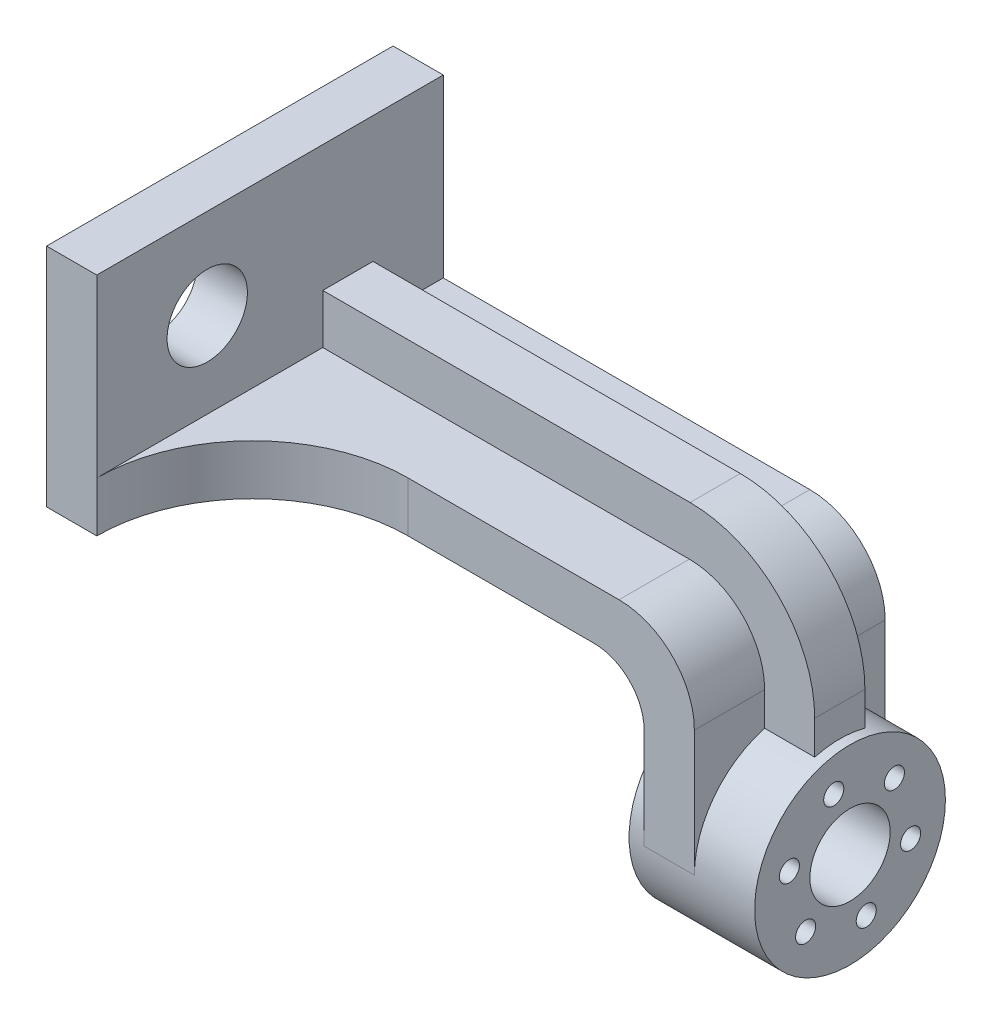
ISO-10303-21;
HEADER;
FILE_DESCRIPTION(('STEP AP214'),'2;1');
FILE_NAME('part.step','',(''),(''),'','','');
FILE_SCHEMA(('AUTOMOTIVE_DESIGN { 1 0 10303 214 1 1 1 1 }'));
ENDSEC;
DATA;
#1=APPLICATION_CONTEXT('core data for automotive mechanical design processes');
#2=APPLICATION_PROTOCOL_DEFINITION('international standard','automotive_design',2000,#1);
#3=PRODUCT_CONTEXT('',#1,'mechanical');
#4=PRODUCT('Part','Part','',(#3));
#5=PRODUCT_RELATED_PRODUCT_CATEGORY('part','',(#4));
#6=PRODUCT_DEFINITION_FORMATION('','',#4);
#7=PRODUCT_DEFINITION_CONTEXT('part definition',#1,'design');
#8=PRODUCT_DEFINITION('design','',#6,#7);
#9=PRODUCT_DEFINITION_SHAPE('','',#8);
#10=(LENGTH_UNIT() NAMED_UNIT(*) SI_UNIT(.MILLI.,.METRE.));
#11=(NAMED_UNIT(*) PLANE_ANGLE_UNIT() SI_UNIT($,.RADIAN.));
#12=(NAMED_UNIT(*) SI_UNIT($,.STERADIAN.) SOLID_ANGLE_UNIT());
#13=UNCERTAINTY_MEASURE_WITH_UNIT(LENGTH_MEASURE(1.E-05),#10,'distance_accuracy_value','');
#14=(GEOMETRIC_REPRESENTATION_CONTEXT(3) GLOBAL_UNCERTAINTY_ASSIGNED_CONTEXT((#13)) GLOBAL_UNIT_ASSIGNED_CONTEXT((#10,
#11,#12)) REPRESENTATION_CONTEXT('',''));
#15=CARTESIAN_POINT('',(0.,0.,0.));
#16=DIRECTION('',(0.,0.,1.));
#17=DIRECTION('',(1.,0.,0.));
#18=AXIS2_PLACEMENT_3D('',#15,#16,#17);
#19=CARTESIAN_POINT('',(98.,-52.5,3.5));
#20=DIRECTION('',(1.,0.,0.));
#21=DIRECTION('',(0.,0.,-1.));
#22=AXIS2_PLACEMENT_3D('',#19,#20,#21);
#23=PLANE('',#22);
#24=CARTESIAN_POINT('',(98.,-52.5,-15.5));
#25=DIRECTION('',(1.,0.,0.));
#26=DIRECTION('',(0.,0.,-1.));
#27=AXIS2_PLACEMENT_3D('',#24,#25,#26);
#28=CIRCLE('',#27,19.);
#29=CARTESIAN_POINT('',(98.,-34.1696972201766,-10.5));
#30=VERTEX_POINT('',#29);
#31=CARTESIAN_POINT('',(98.,-52.5,3.5));
#32=VERTEX_POINT('',#31);
#33=EDGE_CURVE('E283',#30,#32,#28,.T.);
#34=ORIENTED_EDGE('',*,*,#33,.F.);
#35=DIRECTION('',(0.,1.,0.));
#36=VECTOR('',#35,1.);
#37=CARTESIAN_POINT('',(98.,-52.5,-10.5));
#38=LINE('',#37,#36);
#39=CARTESIAN_POINT('',(98.,-27.5,-10.5));
#40=VERTEX_POINT('',#39);
#41=EDGE_CURVE('E211',#30,#40,#38,.T.);
#42=ORIENTED_EDGE('',*,*,#41,.T.);
#43=DIRECTION('',(0.,0.,-1.));
#44=VECTOR('',#43,1.);
#45=CARTESIAN_POINT('',(98.,-27.5,3.5));
#46=LINE('',#45,#44);
#47=CARTESIAN_POINT('',(98.,-27.5,3.5));
#48=VERTEX_POINT('',#47);
#49=EDGE_CURVE('E405',#40,#48,#46,.F.);
#50=ORIENTED_EDGE('',*,*,#49,.T.);
#51=DIRECTION('',(0.,-1.,0.));
#52=VECTOR('',#51,1.);
#53=CARTESIAN_POINT('',(98.,-52.5,3.5));
#54=LINE('',#53,#52);
#55=EDGE_CURVE('E293',#48,#32,#54,.T.);
#56=ORIENTED_EDGE('',*,*,#55,.T.);
#57=EDGE_LOOP('',(#34,#42,#50,#56));
#58=FACE_BOUND('',#57,.T.);
#59=ADVANCED_FACE('F34',(#58),#23,.T.);
#60=CARTESIAN_POINT('',(98.,-12.5,3.5));
#61=DIRECTION('',(0.,1.,0.));
#62=DIRECTION('',(-1.,0.,0.));
#63=AXIS2_PLACEMENT_3D('',#60,#61,#62);
#64=PLANE('',#63);
#65=DIRECTION('',(0.,0.,-1.));
#66=VECTOR('',#65,1.);
#67=CARTESIAN_POINT('',(83.,-12.5,3.5));
#68=LINE('',#67,#66);
#69=CARTESIAN_POINT('',(83.,-12.5,3.5));
#70=VERTEX_POINT('',#69);
#71=CARTESIAN_POINT('',(83.,-12.5,-10.5));
#72=VERTEX_POINT('',#71);
#73=EDGE_CURVE('E323',#70,#72,#68,.T.);
#74=ORIENTED_EDGE('',*,*,#73,.T.);
#75=DIRECTION('',(-1.,0.,0.));
#76=VECTOR('',#75,1.);
#77=CARTESIAN_POINT('',(98.,-12.5,-10.5));
#78=LINE('',#77,#76);
#79=CARTESIAN_POINT('',(10.,-12.5,-10.5));
#80=VERTEX_POINT('',#79);
#81=EDGE_CURVE('E51',#72,#80,#78,.T.);
#82=ORIENTED_EDGE('',*,*,#81,.T.);
#83=DIRECTION('',(0.,0.,-1.));
#84=VECTOR('',#83,1.);
#85=CARTESIAN_POINT('',(10.,-12.5,3.5));
#86=LINE('',#85,#84);
#87=CARTESIAN_POINT('',(10.,-12.5,34.5));
#88=VERTEX_POINT('',#87);
#89=EDGE_CURVE('E58',#88,#80,#86,.T.);
#90=ORIENTED_EDGE('',*,*,#89,.F.);
#91=CARTESIAN_POINT('',(41.,-12.5,34.5));
#92=DIRECTION('',(0.,1.,0.));
#93=DIRECTION('',(-1.,0.,0.));
#94=AXIS2_PLACEMENT_3D('',#91,#92,#93);
#95=CIRCLE('',#94,31.);
#96=CARTESIAN_POINT('',(41.,-12.5,3.5));
#97=VERTEX_POINT('',#96);
#98=EDGE_CURVE('E44',#88,#97,#95,.F.);
#99=ORIENTED_EDGE('',*,*,#98,.T.);
#100=DIRECTION('',(1.,0.,0.));
#101=VECTOR('',#100,1.);
#102=CARTESIAN_POINT('',(98.,-12.5,3.5));
#103=LINE('',#102,#101);
#104=EDGE_CURVE('E290',#97,#70,#103,.T.);
#105=ORIENTED_EDGE('',*,*,#104,.T.);
#106=EDGE_LOOP('',(#74,#82,#90,#99,#105));
#107=FACE_BOUND('',#106,.T.);
#108=ADVANCED_FACE('F344',(#107),#64,.T.);
#109=CARTESIAN_POINT('',(83.,-27.5,3.5));
#110=DIRECTION('',(0.,0.,-1.));
#111=DIRECTION('',(-1.,0.,0.));
#112=AXIS2_PLACEMENT_3D('',#109,#110,#111);
#113=CYLINDRICAL_SURFACE('',#112,15.);
#114=ORIENTED_EDGE('',*,*,#49,.F.);
#115=CARTESIAN_POINT('',(83.,-27.5,-10.5));
#116=DIRECTION('',(0.,0.,-1.));
#117=DIRECTION('',(-1.,0.,0.));
#118=AXIS2_PLACEMENT_3D('',#115,#116,#117);
#119=CIRCLE('',#118,15.);
#120=EDGE_CURVE('E203',#40,#72,#119,.F.);
#121=ORIENTED_EDGE('',*,*,#120,.T.);
#122=ORIENTED_EDGE('',*,*,#73,.F.);
#123=CARTESIAN_POINT('',(83.,-27.5,3.5));
#124=DIRECTION('',(0.,0.,1.));
#125=DIRECTION('',(1.,0.,0.));
#126=AXIS2_PLACEMENT_3D('',#123,#124,#125);
#127=CIRCLE('',#126,15.);
#128=EDGE_CURVE('E332',#48,#70,#127,.T.);
#129=ORIENTED_EDGE('',*,*,#128,.F.);
#130=EDGE_LOOP('',(#114,#121,#122,#129));
#131=FACE_BOUND('',#130,.T.);
#132=ADVANCED_FACE('F408',(#131),#113,.T.);
#133=CARTESIAN_POINT('',(10.,-22.5,-34.5));
#134=DIRECTION('',(0.,0.,1.));
#135=DIRECTION('',(1.,0.,0.));
#136=AXIS2_PLACEMENT_3D('',#133,#134,#135);
#137=PLANE('',#136);
#138=DIRECTION('',(1.,0.,0.));
#139=VECTOR('',#138,1.);
#140=CARTESIAN_POINT('',(98.,-12.5,-34.5));
#141=LINE('',#140,#139);
#142=CARTESIAN_POINT('',(10.,-12.5,-34.5));
#143=VERTEX_POINT('',#142);
#144=CARTESIAN_POINT('',(83.,-12.5,-34.5));
#145=VERTEX_POINT('',#144);
#146=EDGE_CURVE('E289',#143,#145,#141,.T.);
#147=ORIENTED_EDGE('',*,*,#146,.T.);
#148=CARTESIAN_POINT('',(83.,-27.5,-34.5));
#149=DIRECTION('',(0.,0.,1.));
#150=DIRECTION('',(1.,0.,0.));
#151=AXIS2_PLACEMENT_3D('',#148,#149,#150);
#152=CIRCLE('',#151,15.);
#153=CARTESIAN_POINT('',(98.,-27.5,-34.5));
#154=VERTEX_POINT('',#153);
#155=EDGE_CURVE('E392',#145,#154,#152,.F.);
#156=ORIENTED_EDGE('',*,*,#155,.T.);
#157=DIRECTION('',(0.,-1.,0.));
#158=VECTOR('',#157,1.);
#159=CARTESIAN_POINT('',(98.,-52.5,-34.5));
#160=LINE('',#159,#158);
#161=CARTESIAN_POINT('',(98.,-52.5,-34.5));
#162=VERTEX_POINT('',#161);
#163=EDGE_CURVE('E304',#154,#162,#160,.T.);
#164=ORIENTED_EDGE('',*,*,#163,.T.);
#165=DIRECTION('',(-1.,0.,0.));
#166=VECTOR('',#165,1.);
#167=CARTESIAN_POINT('',(88.,-52.5,-34.5));
#168=LINE('',#167,#166);
#169=CARTESIAN_POINT('',(88.,-52.5,-34.5));
#170=VERTEX_POINT('',#169);
#171=EDGE_CURVE('E306',#162,#170,#168,.T.);
#172=ORIENTED_EDGE('',*,*,#171,.T.);
#173=DIRECTION('',(0.,1.,0.));
#174=VECTOR('',#173,1.);
#175=CARTESIAN_POINT('',(88.,-22.5,-34.5));
#176=LINE('',#175,#174);
#177=CARTESIAN_POINT('',(88.,-32.5,-34.5));
#178=VERTEX_POINT('',#177);
#179=EDGE_CURVE('E294',#170,#178,#176,.T.);
#180=ORIENTED_EDGE('',*,*,#179,.T.);
#181=CARTESIAN_POINT('',(78.,-32.5,-34.5));
#182=DIRECTION('',(0.,0.,1.));
#183=DIRECTION('',(1.,0.,0.));
#184=AXIS2_PLACEMENT_3D('',#181,#182,#183);
#185=CIRCLE('',#184,10.);
#186=CARTESIAN_POINT('',(78.,-22.5,-34.5));
#187=VERTEX_POINT('',#186);
#188=EDGE_CURVE('E338',#178,#187,#185,.T.);
#189=ORIENTED_EDGE('',*,*,#188,.T.);
#190=DIRECTION('',(-1.,0.,0.));
#191=VECTOR('',#190,1.);
#192=CARTESIAN_POINT('',(10.,-22.5,-34.5));
#193=LINE('',#192,#191);
#194=CARTESIAN_POINT('',(0.,-22.5,-34.5));
#195=VERTEX_POINT('',#194);
#196=EDGE_CURVE('E371',#187,#195,#193,.T.);
#197=ORIENTED_EDGE('',*,*,#196,.T.);
#198=DIRECTION('',(0.,1.,0.));
#199=VECTOR('',#198,1.);
#200=CARTESIAN_POINT('',(0.,-22.5,-34.5));
#201=LINE('',#200,#199);
#202=CARTESIAN_POINT('',(0.,22.5,-34.5));
#203=VERTEX_POINT('',#202);
#204=EDGE_CURVE('E318',#195,#203,#201,.T.);
#205=ORIENTED_EDGE('',*,*,#204,.T.);
#206=DIRECTION('',(-1.,0.,0.));
#207=VECTOR('',#206,1.);
#208=CARTESIAN_POINT('',(10.,22.5,-34.5));
#209=LINE('',#208,#207);
#210=CARTESIAN_POINT('',(10.,22.5,-34.5));
#211=VERTEX_POINT('',#210);
#212=EDGE_CURVE('E373',#211,#203,#209,.T.);
#213=ORIENTED_EDGE('',*,*,#212,.F.);
#214=DIRECTION('',(0.,1.,0.));
#215=VECTOR('',#214,1.);
#216=CARTESIAN_POINT('',(10.,-22.5,-34.5));
#217=LINE('',#216,#215);
#218=EDGE_CURVE('E383',#143,#211,#217,.T.);
#219=ORIENTED_EDGE('',*,*,#218,.F.);
#220=EDGE_LOOP('',(#147,#156,#164,#172,#180,#189,#197,#205,#213,#219));
#221=FACE_BOUND('',#220,.T.);
#222=ADVANCED_FACE('F390',(#221),#137,.F.);
#223=CARTESIAN_POINT('',(10.,22.5,34.5));
#224=DIRECTION('',(0.,-1.,0.));
#225=DIRECTION('',(0.,0.,-1.));
#226=AXIS2_PLACEMENT_3D('',#223,#224,#225);
#227=PLANE('',#226);
#228=DIRECTION('',(0.,0.,1.));
#229=VECTOR('',#228,1.);
#230=CARTESIAN_POINT('',(0.,22.5,34.5));
#231=LINE('',#230,#229);
#232=CARTESIAN_POINT('',(0.,22.5,34.5));
#233=VERTEX_POINT('',#232);
#234=EDGE_CURVE('E428',#203,#233,#231,.T.);
#235=ORIENTED_EDGE('',*,*,#234,.T.);
#236=DIRECTION('',(-1.,0.,0.));
#237=VECTOR('',#236,1.);
#238=CARTESIAN_POINT('',(10.,22.5,34.5));
#239=LINE('',#238,#237);
#240=CARTESIAN_POINT('',(10.,22.5,34.5));
#241=VERTEX_POINT('',#240);
#242=EDGE_CURVE('E370',#241,#233,#239,.T.);
#243=ORIENTED_EDGE('',*,*,#242,.F.);
#244=DIRECTION('',(0.,0.,1.));
#245=VECTOR('',#244,1.);
#246=CARTESIAN_POINT('',(10.,22.5,34.5));
#247=LINE('',#246,#245);
#248=EDGE_CURVE('E384',#211,#241,#247,.T.);
#249=ORIENTED_EDGE('',*,*,#248,.F.);
#250=ORIENTED_EDGE('',*,*,#212,.T.);
#251=EDGE_LOOP('',(#235,#243,#249,#250));
#252=FACE_BOUND('',#251,.T.);
#253=ADVANCED_FACE('F438',(#252),#227,.F.);
#254=CARTESIAN_POINT('',(10.,-22.5,34.5));
#255=DIRECTION('',(0.,0.,-1.));
#256=DIRECTION('',(-1.,0.,0.));
#257=AXIS2_PLACEMENT_3D('',#254,#255,#256);
#258=PLANE('',#257);
#259=DIRECTION('',(0.,-1.,0.));
#260=VECTOR('',#259,1.);
#261=CARTESIAN_POINT('',(0.,-22.5,34.5));
#262=LINE('',#261,#260);
#263=CARTESIAN_POINT('',(0.,-22.5,34.5));
#264=VERTEX_POINT('',#263);
#265=EDGE_CURVE('E369',#233,#264,#262,.T.);
#266=ORIENTED_EDGE('',*,*,#265,.T.);
#267=DIRECTION('',(-1.,0.,0.));
#268=VECTOR('',#267,1.);
#269=CARTESIAN_POINT('',(10.,-22.5,34.5));
#270=LINE('',#269,#268);
#271=CARTESIAN_POINT('',(10.,-22.5,34.5));
#272=VERTEX_POINT('',#271);
#273=EDGE_CURVE('E361',#272,#264,#270,.T.);
#274=ORIENTED_EDGE('',*,*,#273,.F.);
#275=DIRECTION('',(0.,-1.,0.));
#276=VECTOR('',#275,1.);
#277=CARTESIAN_POINT('',(10.,-22.5,34.5));
#278=LINE('',#277,#276);
#279=EDGE_CURVE('E356',#88,#272,#278,.T.);
#280=ORIENTED_EDGE('',*,*,#279,.F.);
#281=EDGE_CURVE('E376',#241,#88,#278,.T.);
#282=ORIENTED_EDGE('',*,*,#281,.F.);
#283=ORIENTED_EDGE('',*,*,#242,.T.);
#284=EDGE_LOOP('',(#266,#274,#280,#282,#283));
#285=FACE_BOUND('',#284,.T.);
#286=ADVANCED_FACE('F364',(#285),#258,.F.);
#287=CARTESIAN_POINT('',(10.,-22.5,34.5));
#288=DIRECTION('',(0.,1.,0.));
#289=DIRECTION('',(0.,0.,1.));
#290=AXIS2_PLACEMENT_3D('',#287,#288,#289);
#291=PLANE('',#290);
#292=DIRECTION('',(0.,0.,-1.));
#293=VECTOR('',#292,1.);
#294=CARTESIAN_POINT('',(78.,-22.5,34.5));
#295=LINE('',#294,#293);
#296=CARTESIAN_POINT('',(78.,-22.5,3.5));
#297=VERTEX_POINT('',#296);
#298=EDGE_CURVE('E336',#187,#297,#295,.F.);
#299=ORIENTED_EDGE('',*,*,#298,.T.);
#300=DIRECTION('',(-1.,0.,0.));
#301=VECTOR('',#300,1.);
#302=CARTESIAN_POINT('',(10.,-22.5,3.5));
#303=LINE('',#302,#301);
#304=CARTESIAN_POINT('',(41.,-22.5,3.5));
#305=VERTEX_POINT('',#304);
#306=EDGE_CURVE('E303',#297,#305,#303,.T.);
#307=ORIENTED_EDGE('',*,*,#306,.T.);
#308=CARTESIAN_POINT('',(41.,-22.5,34.5));
#309=DIRECTION('',(0.,1.,0.));
#310=DIRECTION('',(0.,0.,1.));
#311=AXIS2_PLACEMENT_3D('',#308,#309,#310);
#312=CIRCLE('',#311,31.);
#313=EDGE_CURVE('E12',#305,#272,#312,.T.);
#314=ORIENTED_EDGE('',*,*,#313,.T.);
#315=ORIENTED_EDGE('',*,*,#273,.T.);
#316=DIRECTION('',(0.,0.,-1.));
#317=VECTOR('',#316,1.);
#318=CARTESIAN_POINT('',(0.,-22.5,34.5));
#319=LINE('',#318,#317);
#320=EDGE_CURVE('E385',#264,#195,#319,.T.);
#321=ORIENTED_EDGE('',*,*,#320,.T.);
#322=ORIENTED_EDGE('',*,*,#196,.F.);
#323=EDGE_LOOP('',(#299,#307,#314,#315,#321,#322));
#324=FACE_BOUND('',#323,.T.);
#325=ADVANCED_FACE('F360',(#324),#291,.F.);
#326=CARTESIAN_POINT('',(10.,22.5,-34.5));
#327=DIRECTION('',(-1.,0.,0.));
#328=DIRECTION('',(0.,0.,1.));
#329=AXIS2_PLACEMENT_3D('',#326,#327,#328);
#330=PLANE('',#329);
#331=CARTESIAN_POINT('',(10.,4.5,12.5));
#332=DIRECTION('',(1.,0.,0.));
#333=DIRECTION('',(0.,0.,-1.));
#334=AXIS2_PLACEMENT_3D('',#331,#332,#333);
#335=CIRCLE('',#334,8.);
#336=CARTESIAN_POINT('',(10.,4.5,4.5));
#337=VERTEX_POINT('',#336);
#338=EDGE_CURVE('E230',#337,#337,#335,.T.);
#339=ORIENTED_EDGE('',*,*,#338,.F.);
#340=EDGE_LOOP('',(#339));
#341=FACE_BOUND('',#340,.T.);
#342=DIRECTION('',(0.,0.,1.));
#343=VECTOR('',#342,1.);
#344=CARTESIAN_POINT('',(10.,-2.65317557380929,-34.5));
#345=LINE('',#344,#343);
#346=CARTESIAN_POINT('',(10.,-2.65317557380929,-10.5));
#347=VERTEX_POINT('',#346);
#348=CARTESIAN_POINT('',(10.,-2.65317557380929,-20.5));
#349=VERTEX_POINT('',#348);
#350=EDGE_CURVE('E226',#347,#349,#345,.F.);
#351=ORIENTED_EDGE('',*,*,#350,.T.);
#352=DIRECTION('',(0.,-1.,0.));
#353=VECTOR('',#352,1.);
#354=CARTESIAN_POINT('',(10.,22.5,-20.5));
#355=LINE('',#354,#353);
#356=CARTESIAN_POINT('',(10.,-12.5,-20.5));
#357=VERTEX_POINT('',#356);
#358=EDGE_CURVE('E217',#349,#357,#355,.T.);
#359=ORIENTED_EDGE('',*,*,#358,.T.);
#360=EDGE_CURVE('E38',#357,#143,#86,.T.);
#361=ORIENTED_EDGE('',*,*,#360,.T.);
#362=ORIENTED_EDGE('',*,*,#218,.T.);
#363=ORIENTED_EDGE('',*,*,#248,.T.);
#364=ORIENTED_EDGE('',*,*,#281,.T.);
#365=ORIENTED_EDGE('',*,*,#89,.T.);
#366=DIRECTION('',(0.,-1.,0.));
#367=VECTOR('',#366,1.);
#368=CARTESIAN_POINT('',(10.,22.5,-10.5));
#369=LINE('',#368,#367);
#370=EDGE_CURVE('E208',#347,#80,#369,.T.);
#371=ORIENTED_EDGE('',*,*,#370,.F.);
#372=EDGE_LOOP('',(#351,#359,#361,#362,#363,#364,#365,#371));
#373=FACE_BOUND('',#372,.T.);
#374=ADVANCED_FACE('F421',(#341,#373),#330,.F.);
#375=CARTESIAN_POINT('',(0.,22.5,-34.5));
#376=DIRECTION('',(-1.,0.,0.));
#377=DIRECTION('',(0.,0.,1.));
#378=AXIS2_PLACEMENT_3D('',#375,#376,#377);
#379=PLANE('',#378);
#380=ORIENTED_EDGE('',*,*,#204,.F.);
#381=ORIENTED_EDGE('',*,*,#320,.F.);
#382=ORIENTED_EDGE('',*,*,#265,.F.);
#383=ORIENTED_EDGE('',*,*,#234,.F.);
#384=EDGE_LOOP('',(#380,#381,#382,#383));
#385=FACE_BOUND('',#384,.T.);
#386=CARTESIAN_POINT('',(0.,4.5,12.5));
#387=DIRECTION('',(-1.,0.,0.));
#388=DIRECTION('',(0.,0.,1.));
#389=AXIS2_PLACEMENT_3D('',#386,#387,#388);
#390=CIRCLE('',#389,8.);
#391=CARTESIAN_POINT('',(0.,4.5,20.5));
#392=VERTEX_POINT('',#391);
#393=EDGE_CURVE('E229',#392,#392,#390,.F.);
#394=ORIENTED_EDGE('',*,*,#393,.T.);
#395=EDGE_LOOP('',(#394));
#396=FACE_BOUND('',#395,.T.);
#397=ADVANCED_FACE('F435',(#385,#396),#379,.T.);
#398=CARTESIAN_POINT('',(88.,-22.5,3.5));
#399=DIRECTION('',(-1.,0.,0.));
#400=DIRECTION('',(0.,0.,1.));
#401=AXIS2_PLACEMENT_3D('',#398,#399,#400);
#402=PLANE('',#401);
#403=ORIENTED_EDGE('',*,*,#179,.F.);
#404=CARTESIAN_POINT('',(88.,-52.5,-15.5));
#405=DIRECTION('',(-1.,0.,0.));
#406=DIRECTION('',(0.,0.,1.));
#407=AXIS2_PLACEMENT_3D('',#404,#405,#406);
#408=CIRCLE('',#407,19.);
#409=CARTESIAN_POINT('',(88.,-52.5,3.5));
#410=VERTEX_POINT('',#409);
#411=EDGE_CURVE('E287',#410,#170,#408,.T.);
#412=ORIENTED_EDGE('',*,*,#411,.F.);
#413=DIRECTION('',(0.,1.,0.));
#414=VECTOR('',#413,1.);
#415=CARTESIAN_POINT('',(88.,-22.5,3.5));
#416=LINE('',#415,#414);
#417=CARTESIAN_POINT('',(88.,-32.5,3.5));
#418=VERTEX_POINT('',#417);
#419=EDGE_CURVE('E300',#410,#418,#416,.T.);
#420=ORIENTED_EDGE('',*,*,#419,.T.);
#421=DIRECTION('',(0.,0.,-1.));
#422=VECTOR('',#421,1.);
#423=CARTESIAN_POINT('',(88.,-32.5,3.5));
#424=LINE('',#423,#422);
#425=EDGE_CURVE('E334',#418,#178,#424,.T.);
#426=ORIENTED_EDGE('',*,*,#425,.T.);
#427=EDGE_LOOP('',(#403,#412,#420,#426));
#428=FACE_BOUND('',#427,.T.);
#429=ADVANCED_FACE('F456',(#428),#402,.T.);
#430=DIRECTION('',(0.,1.,0.));
#431=VECTOR('',#430,1.);
#432=CARTESIAN_POINT('',(98.,-52.5,-20.5));
#433=LINE('',#432,#431);
#434=CARTESIAN_POINT('',(98.,-34.1696972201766,-20.5));
#435=VERTEX_POINT('',#434);
#436=CARTESIAN_POINT('',(98.,-27.5,-20.5));
#437=VERTEX_POINT('',#436);
#438=EDGE_CURVE('E221',#435,#437,#433,.T.);
#439=ORIENTED_EDGE('',*,*,#438,.F.);
#440=EDGE_CURVE('E284',#162,#435,#28,.T.);
#441=ORIENTED_EDGE('',*,*,#440,.F.);
#442=ORIENTED_EDGE('',*,*,#163,.F.);
#443=EDGE_CURVE('E329',#154,#437,#46,.F.);
#444=ORIENTED_EDGE('',*,*,#443,.T.);
#445=EDGE_LOOP('',(#439,#441,#442,#444));
#446=FACE_BOUND('',#445,.T.);
#447=ADVANCED_FACE('F449',(#446),#23,.T.);
#448=DIRECTION('',(-1.,0.,0.));
#449=VECTOR('',#448,1.);
#450=CARTESIAN_POINT('',(98.,-12.5,-20.5));
#451=LINE('',#450,#449);
#452=CARTESIAN_POINT('',(83.,-12.5,-20.5));
#453=VERTEX_POINT('',#452);
#454=EDGE_CURVE('E219',#453,#357,#451,.T.);
#455=ORIENTED_EDGE('',*,*,#454,.F.);
#456=EDGE_CURVE('E382',#453,#145,#68,.T.);
#457=ORIENTED_EDGE('',*,*,#456,.T.);
#458=ORIENTED_EDGE('',*,*,#146,.F.);
#459=ORIENTED_EDGE('',*,*,#360,.F.);
#460=EDGE_LOOP('',(#455,#457,#458,#459));
#461=FACE_BOUND('',#460,.T.);
#462=ADVANCED_FACE('F398',(#461),#64,.T.);
#463=CARTESIAN_POINT('',(10.,-22.5,3.5));
#464=DIRECTION('',(0.,0.,1.));
#465=DIRECTION('',(1.,0.,0.));
#466=AXIS2_PLACEMENT_3D('',#463,#464,#465);
#467=PLANE('',#466);
#468=ORIENTED_EDGE('',*,*,#55,.F.);
#469=ORIENTED_EDGE('',*,*,#128,.T.);
#470=ORIENTED_EDGE('',*,*,#104,.F.);
#471=DIRECTION('',(0.,1.,0.));
#472=VECTOR('',#471,1.);
#473=CARTESIAN_POINT('',(41.,-22.5,3.5));
#474=LINE('',#473,#472);
#475=EDGE_CURVE('E330',#97,#305,#474,.F.);
#476=ORIENTED_EDGE('',*,*,#475,.T.);
#477=ORIENTED_EDGE('',*,*,#306,.F.);
#478=CARTESIAN_POINT('',(78.,-32.5,3.5));
#479=DIRECTION('',(0.,0.,1.));
#480=DIRECTION('',(1.,0.,0.));
#481=AXIS2_PLACEMENT_3D('',#478,#479,#480);
#482=CIRCLE('',#481,10.);
#483=EDGE_CURVE('E340',#297,#418,#482,.F.);
#484=ORIENTED_EDGE('',*,*,#483,.T.);
#485=ORIENTED_EDGE('',*,*,#419,.F.);
#486=DIRECTION('',(-1.,0.,0.));
#487=VECTOR('',#486,1.);
#488=CARTESIAN_POINT('',(88.,-52.5,3.5));
#489=LINE('',#488,#487);
#490=EDGE_CURVE('E297',#32,#410,#489,.T.);
#491=ORIENTED_EDGE('',*,*,#490,.F.);
#492=EDGE_LOOP('',(#468,#469,#470,#476,#477,#484,#485,#491));
#493=FACE_BOUND('',#492,.T.);
#494=ADVANCED_FACE('F352',(#493),#467,.T.);
#495=CARTESIAN_POINT('',(85.,-52.5,-15.5));
#496=DIRECTION('',(1.,0.,0.));
#497=DIRECTION('',(0.,0.,-1.));
#498=AXIS2_PLACEMENT_3D('',#495,#496,#497);
#499=CYLINDRICAL_SURFACE('',#498,19.);
#500=CARTESIAN_POINT('',(85.,-52.5,-15.5));
#501=DIRECTION('',(1.,0.,0.));
#502=DIRECTION('',(0.,0.,-1.));
#503=AXIS2_PLACEMENT_3D('',#500,#501,#502);
#504=CIRCLE('',#503,19.);
#505=CARTESIAN_POINT('',(85.,-52.5,-34.5));
#506=VERTEX_POINT('',#505);
#507=EDGE_CURVE('E280',#506,#506,#504,.T.);
#508=ORIENTED_EDGE('',*,*,#507,.T.);
#509=EDGE_LOOP('',(#508));
#510=FACE_BOUND('',#509,.T.);
#511=ORIENTED_EDGE('',*,*,#411,.T.);
#512=ORIENTED_EDGE('',*,*,#171,.F.);
#513=ORIENTED_EDGE('',*,*,#440,.T.);
#514=DIRECTION('',(1.,0.,0.));
#515=VECTOR('',#514,1.);
#516=CARTESIAN_POINT('',(85.,-34.1696972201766,-20.5));
#517=LINE('',#516,#515);
#518=CARTESIAN_POINT('',(107.967626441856,-34.1696972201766,-20.5));
#519=VERTEX_POINT('',#518);
#520=EDGE_CURVE('E215',#519,#435,#517,.F.);
#521=ORIENTED_EDGE('',*,*,#520,.F.);
#522=CARTESIAN_POINT('',(107.967626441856,-52.5,-15.5));
#523=DIRECTION('',(-1.,0.,0.));
#524=DIRECTION('',(0.,-1.,0.));
#525=AXIS2_PLACEMENT_3D('',#522,#523,#524);
#526=CIRCLE('',#525,19.);
#527=CARTESIAN_POINT('',(107.967626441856,-34.1696972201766,-10.5));
#528=VERTEX_POINT('',#527);
#529=EDGE_CURVE('E176',#528,#519,#526,.T.);
#530=ORIENTED_EDGE('',*,*,#529,.F.);
#531=DIRECTION('',(1.,0.,0.));
#532=VECTOR('',#531,1.);
#533=CARTESIAN_POINT('',(85.,-34.1696972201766,-10.5));
#534=LINE('',#533,#532);
#535=EDGE_CURVE('E204',#528,#30,#534,.F.);
#536=ORIENTED_EDGE('',*,*,#535,.T.);
#537=ORIENTED_EDGE('',*,*,#33,.T.);
#538=ORIENTED_EDGE('',*,*,#490,.T.);
#539=EDGE_LOOP('',(#511,#512,#513,#521,#530,#536,#537,#538));
#540=FACE_BOUND('',#539,.T.);
#541=CARTESIAN_POINT('',(110.,-52.5,-15.5));
#542=DIRECTION('',(1.,0.,0.));
#543=DIRECTION('',(0.,0.,-1.));
#544=AXIS2_PLACEMENT_3D('',#541,#542,#543);
#545=CIRCLE('',#544,19.);
#546=CARTESIAN_POINT('',(110.,-52.5,-34.5));
#547=VERTEX_POINT('',#546);
#548=EDGE_CURVE('E277',#547,#547,#545,.T.);
#549=ORIENTED_EDGE('',*,*,#548,.F.);
#550=EDGE_LOOP('',(#549));
#551=FACE_BOUND('',#550,.T.);
#552=ADVANCED_FACE('F414',(#510,#540,#551),#499,.T.);
#553=CARTESIAN_POINT('',(85.,-52.5,-15.5));
#554=DIRECTION('',(1.,0.,0.));
#555=DIRECTION('',(0.,0.,-1.));
#556=AXIS2_PLACEMENT_3D('',#553,#554,#555);
#557=PLANE('',#556);
#558=CARTESIAN_POINT('',(85.,-64.5740728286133,-18.7352380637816));
#559=DIRECTION('',(1.,0.,0.));
#560=DIRECTION('',(0.,0.,-1.));
#561=AXIS2_PLACEMENT_3D('',#558,#559,#560);
#562=CIRCLE('',#561,2.);
#563=CARTESIAN_POINT('',(85.,-64.5740728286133,-20.7352380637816));
#564=VERTEX_POINT('',#563);
#565=EDGE_CURVE('E244',#564,#564,#562,.F.);
#566=ORIENTED_EDGE('',*,*,#565,.F.);
#567=EDGE_LOOP('',(#566));
#568=FACE_BOUND('',#567,.T.);
#569=CARTESIAN_POINT('',(85.,-52.5,-15.5));
#570=DIRECTION('',(1.,0.,0.));
#571=DIRECTION('',(0.,0.,-1.));
#572=AXIS2_PLACEMENT_3D('',#569,#570,#571);
#573=CIRCLE('',#572,8.);
#574=CARTESIAN_POINT('',(85.,-52.5,-23.5));
#575=VERTEX_POINT('',#574);
#576=EDGE_CURVE('E274',#575,#575,#573,.F.);
#577=ORIENTED_EDGE('',*,*,#576,.F.);
#578=EDGE_LOOP('',(#577));
#579=FACE_BOUND('',#578,.T.);
#580=CARTESIAN_POINT('',(85.,-55.7352380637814,-27.5740728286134));
#581=DIRECTION('',(1.,0.,0.));
#582=DIRECTION('',(0.,0.,-1.));
#583=AXIS2_PLACEMENT_3D('',#580,#581,#582);
#584=CIRCLE('',#583,2.);
#585=CARTESIAN_POINT('',(85.,-55.7352380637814,-29.5740728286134));
#586=VERTEX_POINT('',#585);
#587=EDGE_CURVE('E238',#586,#586,#584,.F.);
#588=ORIENTED_EDGE('',*,*,#587,.F.);
#589=EDGE_LOOP('',(#588));
#590=FACE_BOUND('',#589,.T.);
#591=ORIENTED_EDGE('',*,*,#507,.F.);
#592=EDGE_LOOP('',(#591));
#593=FACE_BOUND('',#592,.T.);
#594=CARTESIAN_POINT('',(85.,-43.6611652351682,-24.3388347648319));
#595=DIRECTION('',(1.,0.,0.));
#596=DIRECTION('',(0.,0.,-1.));
#597=AXIS2_PLACEMENT_3D('',#594,#595,#596);
#598=CIRCLE('',#597,2.);
#599=CARTESIAN_POINT('',(85.,-43.6611652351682,-26.3388347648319));
#600=VERTEX_POINT('',#599);
#601=EDGE_CURVE('E268',#600,#600,#598,.F.);
#602=ORIENTED_EDGE('',*,*,#601,.F.);
#603=EDGE_LOOP('',(#602));
#604=FACE_BOUND('',#603,.T.);
#605=CARTESIAN_POINT('',(85.,-40.4259271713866,-12.2647619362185));
#606=DIRECTION('',(1.,0.,0.));
#607=DIRECTION('',(0.,0.,-1.));
#608=AXIS2_PLACEMENT_3D('',#605,#606,#607);
#609=CIRCLE('',#608,2.);
#610=CARTESIAN_POINT('',(85.,-40.4259271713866,-14.2647619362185));
#611=VERTEX_POINT('',#610);
#612=EDGE_CURVE('E262',#611,#611,#609,.F.);
#613=ORIENTED_EDGE('',*,*,#612,.F.);
#614=EDGE_LOOP('',(#613));
#615=FACE_BOUND('',#614,.T.);
#616=CARTESIAN_POINT('',(85.,-49.2647619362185,-3.42592717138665));
#617=DIRECTION('',(1.,0.,0.));
#618=DIRECTION('',(0.,0.,-1.));
#619=AXIS2_PLACEMENT_3D('',#616,#617,#618);
#620=CIRCLE('',#619,2.);
#621=CARTESIAN_POINT('',(85.,-49.2647619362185,-5.42592717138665));
#622=VERTEX_POINT('',#621);
#623=EDGE_CURVE('E256',#622,#622,#620,.F.);
#624=ORIENTED_EDGE('',*,*,#623,.F.);
#625=EDGE_LOOP('',(#624));
#626=FACE_BOUND('',#625,.T.);
#627=CARTESIAN_POINT('',(85.,-61.3388347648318,-6.66116523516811));
#628=DIRECTION('',(1.,0.,0.));
#629=DIRECTION('',(0.,0.,-1.));
#630=AXIS2_PLACEMENT_3D('',#627,#628,#629);
#631=CIRCLE('',#630,2.);
#632=CARTESIAN_POINT('',(85.,-61.3388347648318,-8.66116523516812));
#633=VERTEX_POINT('',#632);
#634=EDGE_CURVE('E250',#633,#633,#631,.F.);
#635=ORIENTED_EDGE('',*,*,#634,.F.);
#636=EDGE_LOOP('',(#635));
#637=FACE_BOUND('',#636,.T.);
#638=ADVANCED_FACE('F614',(#568,#579,#590,#593,#604,#615,#626,#637),#557,.F.);
#639=CARTESIAN_POINT('',(110.,-52.5,-15.5));
#640=DIRECTION('',(1.,0.,0.));
#641=DIRECTION('',(0.,0.,-1.));
#642=AXIS2_PLACEMENT_3D('',#639,#640,#641);
#643=PLANE('',#642);
#644=CARTESIAN_POINT('',(110.,-55.7352380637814,-27.5740728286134));
#645=DIRECTION('',(1.,0.,0.));
#646=DIRECTION('',(0.,-0.866025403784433,-0.50000000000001));
#647=AXIS2_PLACEMENT_3D('',#644,#645,#646);
#648=CIRCLE('',#647,2.);
#649=CARTESIAN_POINT('',(110.,-55.7352380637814,-29.5740728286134));
#650=VERTEX_POINT('',#649);
#651=EDGE_CURVE('E233',#650,#650,#648,.T.);
#652=ORIENTED_EDGE('',*,*,#651,.F.);
#653=EDGE_LOOP('',(#652));
#654=FACE_BOUND('',#653,.T.);
#655=CARTESIAN_POINT('',(110.,-64.5740728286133,-18.7352380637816));
#656=DIRECTION('',(1.,0.,0.));
#657=DIRECTION('',(0.,-0.866025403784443,0.499999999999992));
#658=AXIS2_PLACEMENT_3D('',#655,#656,#657);
#659=CIRCLE('',#658,2.);
#660=CARTESIAN_POINT('',(110.,-64.5740728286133,-20.7352380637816));
#661=VERTEX_POINT('',#660);
#662=EDGE_CURVE('E241',#661,#661,#659,.T.);
#663=ORIENTED_EDGE('',*,*,#662,.F.);
#664=EDGE_LOOP('',(#663));
#665=FACE_BOUND('',#664,.T.);
#666=CARTESIAN_POINT('',(110.,-61.3388347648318,-6.66116523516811));
#667=DIRECTION('',(1.,0.,0.));
#668=DIRECTION('',(0.,0.,1.));
#669=AXIS2_PLACEMENT_3D('',#666,#667,#668);
#670=CIRCLE('',#669,2.);
#671=CARTESIAN_POINT('',(110.,-61.3388347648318,-8.66116523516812));
#672=VERTEX_POINT('',#671);
#673=EDGE_CURVE('E247',#672,#672,#670,.T.);
#674=ORIENTED_EDGE('',*,*,#673,.F.);
#675=EDGE_LOOP('',(#674));
#676=FACE_BOUND('',#675,.T.);
#677=CARTESIAN_POINT('',(110.,-49.2647619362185,-3.42592717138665));
#678=DIRECTION('',(1.,0.,0.));
#679=DIRECTION('',(0.,0.866025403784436,0.500000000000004));
#680=AXIS2_PLACEMENT_3D('',#677,#678,#679);
#681=CIRCLE('',#680,2.);
#682=CARTESIAN_POINT('',(110.,-49.2647619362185,-5.42592717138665));
#683=VERTEX_POINT('',#682);
#684=EDGE_CURVE('E253',#683,#683,#681,.T.);
#685=ORIENTED_EDGE('',*,*,#684,.F.);
#686=EDGE_LOOP('',(#685));
#687=FACE_BOUND('',#686,.T.);
#688=CARTESIAN_POINT('',(110.,-40.4259271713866,-12.2647619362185));
#689=DIRECTION('',(1.,0.,0.));
#690=DIRECTION('',(0.,0.86602540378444,-0.499999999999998));
#691=AXIS2_PLACEMENT_3D('',#688,#689,#690);
#692=CIRCLE('',#691,2.);
#693=CARTESIAN_POINT('',(110.,-40.4259271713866,-14.2647619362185));
#694=VERTEX_POINT('',#693);
#695=EDGE_CURVE('E259',#694,#694,#692,.T.);
#696=ORIENTED_EDGE('',*,*,#695,.F.);
#697=EDGE_LOOP('',(#696));
#698=FACE_BOUND('',#697,.T.);
#699=CARTESIAN_POINT('',(110.,-43.6611652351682,-24.3388347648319));
#700=DIRECTION('',(1.,0.,0.));
#701=DIRECTION('',(0.,0.,-1.));
#702=AXIS2_PLACEMENT_3D('',#699,#700,#701);
#703=CIRCLE('',#702,2.);
#704=CARTESIAN_POINT('',(110.,-43.6611652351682,-26.3388347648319));
#705=VERTEX_POINT('',#704);
#706=EDGE_CURVE('E265',#705,#705,#703,.T.);
#707=ORIENTED_EDGE('',*,*,#706,.F.);
#708=EDGE_LOOP('',(#707));
#709=FACE_BOUND('',#708,.T.);
#710=CARTESIAN_POINT('',(110.,-52.5,-15.5));
#711=DIRECTION('',(1.,0.,0.));
#712=DIRECTION('',(0.,0.,-1.));
#713=AXIS2_PLACEMENT_3D('',#710,#711,#712);
#714=CIRCLE('',#713,8.);
#715=CARTESIAN_POINT('',(110.,-52.5,-23.5));
#716=VERTEX_POINT('',#715);
#717=EDGE_CURVE('E271',#716,#716,#714,.T.);
#718=ORIENTED_EDGE('',*,*,#717,.F.);
#719=EDGE_LOOP('',(#718));
#720=FACE_BOUND('',#719,.T.);
#721=ORIENTED_EDGE('',*,*,#548,.T.);
#722=EDGE_LOOP('',(#721));
#723=FACE_BOUND('',#722,.T.);
#724=ADVANCED_FACE('F610',(#654,#665,#676,#687,#698,#709,#720,#723),#643,.T.);
#725=CARTESIAN_POINT('',(-0.001000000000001,-52.5,-15.5));
#726=DIRECTION('',(1.,0.,0.));
#727=DIRECTION('',(0.,0.,-1.));
#728=AXIS2_PLACEMENT_3D('',#725,#726,#727);
#729=CYLINDRICAL_SURFACE('',#728,8.);
#730=CARTESIAN_POINT('',(85.,-52.5,-23.5));
#731=CARTESIAN_POINT('',(85.2604166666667,-52.5,-23.5));
#732=CARTESIAN_POINT('',(85.5208333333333,-52.5,-23.5));
#733=CARTESIAN_POINT('',(86.0416666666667,-52.5,-23.5));
#734=CARTESIAN_POINT('',(86.3020833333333,-52.5,-23.5));
#735=CARTESIAN_POINT('',(86.8229166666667,-52.5,-23.5));
#736=CARTESIAN_POINT('',(87.0833333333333,-52.5,-23.5));
#737=CARTESIAN_POINT('',(87.6041666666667,-52.5,-23.5));
#738=CARTESIAN_POINT('',(87.8645833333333,-52.5,-23.5));
#739=CARTESIAN_POINT('',(88.3854166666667,-52.5,-23.5));
#740=CARTESIAN_POINT('',(88.6458333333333,-52.5,-23.5));
#741=CARTESIAN_POINT('',(89.1666666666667,-52.5,-23.5));
#742=CARTESIAN_POINT('',(89.4270833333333,-52.5,-23.5));
#743=CARTESIAN_POINT('',(89.9479166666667,-52.5,-23.5));
#744=CARTESIAN_POINT('',(90.2083333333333,-52.5,-23.5));
#745=CARTESIAN_POINT('',(90.7291666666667,-52.5,-23.5));
#746=CARTESIAN_POINT('',(90.9895833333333,-52.5,-23.5));
#747=CARTESIAN_POINT('',(91.5104166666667,-52.5,-23.5));
#748=CARTESIAN_POINT('',(91.7708333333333,-52.5,-23.5));
#749=CARTESIAN_POINT('',(92.2916666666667,-52.5,-23.5));
#750=CARTESIAN_POINT('',(92.5520833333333,-52.5,-23.5));
#751=CARTESIAN_POINT('',(93.0729166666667,-52.5,-23.5));
#752=CARTESIAN_POINT('',(93.3333333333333,-52.5,-23.5));
#753=CARTESIAN_POINT('',(93.8541666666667,-52.5,-23.5));
#754=CARTESIAN_POINT('',(94.1145833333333,-52.5,-23.5));
#755=CARTESIAN_POINT('',(94.6354166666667,-52.5,-23.5));
#756=CARTESIAN_POINT('',(94.8958333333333,-52.5,-23.5));
#757=CARTESIAN_POINT('',(95.4166666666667,-52.5,-23.5));
#758=CARTESIAN_POINT('',(95.6770833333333,-52.5,-23.5));
#759=CARTESIAN_POINT('',(96.1979166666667,-52.5,-23.5));
#760=CARTESIAN_POINT('',(96.4583333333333,-52.5,-23.5));
#761=CARTESIAN_POINT('',(96.9791666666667,-52.5,-23.5));
#762=CARTESIAN_POINT('',(97.2395833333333,-52.5,-23.5));
#763=CARTESIAN_POINT('',(97.7604166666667,-52.5,-23.5));
#764=CARTESIAN_POINT('',(98.0208333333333,-52.5,-23.5));
#765=CARTESIAN_POINT('',(98.5416666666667,-52.5,-23.5));
#766=CARTESIAN_POINT('',(98.8020833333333,-52.5,-23.5));
#767=CARTESIAN_POINT('',(99.3229166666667,-52.5,-23.5));
#768=CARTESIAN_POINT('',(99.5833333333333,-52.5,-23.5));
#769=CARTESIAN_POINT('',(100.104166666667,-52.5,-23.5));
#770=CARTESIAN_POINT('',(100.364583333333,-52.5,-23.5));
#771=CARTESIAN_POINT('',(100.885416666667,-52.5,-23.5));
#772=CARTESIAN_POINT('',(101.145833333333,-52.5,-23.5));
#773=CARTESIAN_POINT('',(101.666666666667,-52.5,-23.5));
#774=CARTESIAN_POINT('',(101.927083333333,-52.5,-23.5));
#775=CARTESIAN_POINT('',(102.447916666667,-52.5,-23.5));
#776=CARTESIAN_POINT('',(102.708333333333,-52.5,-23.5));
#777=CARTESIAN_POINT('',(103.229166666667,-52.5,-23.5));
#778=CARTESIAN_POINT('',(103.489583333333,-52.5,-23.5));
#779=CARTESIAN_POINT('',(104.010416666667,-52.5,-23.5));
#780=CARTESIAN_POINT('',(104.270833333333,-52.5,-23.5));
#781=CARTESIAN_POINT('',(104.791666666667,-52.5,-23.5));
#782=CARTESIAN_POINT('',(105.052083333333,-52.5,-23.5));
#783=CARTESIAN_POINT('',(105.572916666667,-52.5,-23.5));
#784=CARTESIAN_POINT('',(105.833333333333,-52.5,-23.5));
#785=CARTESIAN_POINT('',(106.354166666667,-52.5,-23.5));
#786=CARTESIAN_POINT('',(106.614583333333,-52.5,-23.5));
#787=CARTESIAN_POINT('',(107.135416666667,-52.5,-23.5));
#788=CARTESIAN_POINT('',(107.395833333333,-52.5,-23.5));
#789=CARTESIAN_POINT('',(107.916666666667,-52.5,-23.5));
#790=CARTESIAN_POINT('',(108.177083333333,-52.5,-23.5));
#791=CARTESIAN_POINT('',(108.697916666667,-52.5,-23.5));
#792=CARTESIAN_POINT('',(108.958333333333,-52.5,-23.5));
#793=CARTESIAN_POINT('',(109.479166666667,-52.5,-23.5));
#794=CARTESIAN_POINT('',(109.739583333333,-52.5,-23.5));
#795=CARTESIAN_POINT('',(110.,-52.5,-23.5));
#796=B_SPLINE_CURVE_WITH_KNOTS('',3,(#730,#731,#732,#733,#734,#735,#736,#737,#738,#739,#740,
#741,#742,#743,#744,#745,#746,#747,#748,#749,#750,#751,#752,#753,#754,#755,#756,#757,#758,#759,
#760,#761,#762,#763,#764,#765,#766,#767,#768,#769,#770,#771,#772,#773,#774,#775,#776,#777,#778,
#779,#780,#781,#782,#783,#784,#785,#786,#787,#788,#789,#790,#791,#792,#793,#794,#795),
.UNSPECIFIED.,.F.,.F.,(4,2,2,2,2,2,2,2,2,2,2,2,2,2,2,2,2,2,2,2,2,2,2,2,2,2,2,2,2,2,2,2,4),(0.,
0.781249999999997,1.56249999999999,2.34375000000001,3.125,3.90625,4.6875,5.46874999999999,
6.25000000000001,7.03125,7.8125,8.59375,9.37499999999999,10.15625,10.9375,11.71875,12.5,
13.28125,14.0625,14.84375,15.625,16.40625,17.1875,17.96875,18.75,19.53125,20.3125,21.09375,
21.875,22.65625,23.4375,24.21875,25.),.UNSPECIFIED.);
#797=EDGE_CURVE('BSEAM606',#575,#716,#796,.T.);
#798=ORIENTED_EDGE('',*,*,#576,.T.);
#799=ORIENTED_EDGE('',*,*,#717,.T.);
#800=ORIENTED_EDGE('',*,*,#797,.T.);
#801=ORIENTED_EDGE('',*,*,#797,.F.);
#802=EDGE_LOOP('',(#798,#800,#799,#801));
#803=FACE_BOUND('',#802,.T.);
#804=ADVANCED_FACE('F606',(#803),#729,.F.);
#805=CARTESIAN_POINT('',(-0.001000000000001,-43.6611652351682,-24.3388347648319));
#806=DIRECTION('',(1.,0.,0.));
#807=DIRECTION('',(0.,0.,-1.));
#808=AXIS2_PLACEMENT_3D('',#805,#806,#807);
#809=CYLINDRICAL_SURFACE('',#808,2.);
#810=CARTESIAN_POINT('',(110.,-43.6611652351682,-26.3388347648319));
#811=CARTESIAN_POINT('',(109.739583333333,-43.6611652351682,-26.3388347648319));
#812=CARTESIAN_POINT('',(109.479166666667,-43.6611652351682,-26.3388347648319));
#813=CARTESIAN_POINT('',(108.958333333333,-43.6611652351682,-26.3388347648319));
#814=CARTESIAN_POINT('',(108.697916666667,-43.6611652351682,-26.3388347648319));
#815=CARTESIAN_POINT('',(108.177083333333,-43.6611652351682,-26.3388347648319));
#816=CARTESIAN_POINT('',(107.916666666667,-43.6611652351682,-26.3388347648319));
#817=CARTESIAN_POINT('',(107.395833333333,-43.6611652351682,-26.3388347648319));
#818=CARTESIAN_POINT('',(107.135416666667,-43.6611652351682,-26.3388347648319));
#819=CARTESIAN_POINT('',(106.614583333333,-43.6611652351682,-26.3388347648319));
#820=CARTESIAN_POINT('',(106.354166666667,-43.6611652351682,-26.3388347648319));
#821=CARTESIAN_POINT('',(105.833333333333,-43.6611652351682,-26.3388347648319));
#822=CARTESIAN_POINT('',(105.572916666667,-43.6611652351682,-26.3388347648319));
#823=CARTESIAN_POINT('',(105.052083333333,-43.6611652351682,-26.3388347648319));
#824=CARTESIAN_POINT('',(104.791666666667,-43.6611652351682,-26.3388347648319));
#825=CARTESIAN_POINT('',(104.270833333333,-43.6611652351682,-26.3388347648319));
#826=CARTESIAN_POINT('',(104.010416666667,-43.6611652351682,-26.3388347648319));
#827=CARTESIAN_POINT('',(103.489583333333,-43.6611652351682,-26.3388347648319));
#828=CARTESIAN_POINT('',(103.229166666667,-43.6611652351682,-26.3388347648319));
#829=CARTESIAN_POINT('',(102.708333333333,-43.6611652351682,-26.3388347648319));
#830=CARTESIAN_POINT('',(102.447916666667,-43.6611652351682,-26.3388347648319));
#831=CARTESIAN_POINT('',(101.927083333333,-43.6611652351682,-26.3388347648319));
#832=CARTESIAN_POINT('',(101.666666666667,-43.6611652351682,-26.3388347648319));
#833=CARTESIAN_POINT('',(101.145833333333,-43.6611652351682,-26.3388347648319));
#834=CARTESIAN_POINT('',(100.885416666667,-43.6611652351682,-26.3388347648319));
#835=CARTESIAN_POINT('',(100.364583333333,-43.6611652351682,-26.3388347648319));
#836=CARTESIAN_POINT('',(100.104166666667,-43.6611652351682,-26.3388347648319));
#837=CARTESIAN_POINT('',(99.5833333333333,-43.6611652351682,-26.3388347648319));
#838=CARTESIAN_POINT('',(99.3229166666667,-43.6611652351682,-26.3388347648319));
#839=CARTESIAN_POINT('',(98.8020833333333,-43.6611652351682,-26.3388347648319));
#840=CARTESIAN_POINT('',(98.5416666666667,-43.6611652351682,-26.3388347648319));
#841=CARTESIAN_POINT('',(98.0208333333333,-43.6611652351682,-26.3388347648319));
#842=CARTESIAN_POINT('',(97.7604166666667,-43.6611652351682,-26.3388347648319));
#843=CARTESIAN_POINT('',(97.2395833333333,-43.6611652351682,-26.3388347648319));
#844=CARTESIAN_POINT('',(96.9791666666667,-43.6611652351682,-26.3388347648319));
#845=CARTESIAN_POINT('',(96.4583333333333,-43.6611652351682,-26.3388347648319));
#846=CARTESIAN_POINT('',(96.1979166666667,-43.6611652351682,-26.3388347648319));
#847=CARTESIAN_POINT('',(95.6770833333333,-43.6611652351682,-26.3388347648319));
#848=CARTESIAN_POINT('',(95.4166666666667,-43.6611652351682,-26.3388347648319));
#849=CARTESIAN_POINT('',(94.8958333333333,-43.6611652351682,-26.3388347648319));
#850=CARTESIAN_POINT('',(94.6354166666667,-43.6611652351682,-26.3388347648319));
#851=CARTESIAN_POINT('',(94.1145833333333,-43.6611652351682,-26.3388347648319));
#852=CARTESIAN_POINT('',(93.8541666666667,-43.6611652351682,-26.3388347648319));
#853=CARTESIAN_POINT('',(93.3333333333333,-43.6611652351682,-26.3388347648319));
#854=CARTESIAN_POINT('',(93.0729166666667,-43.6611652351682,-26.3388347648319));
#855=CARTESIAN_POINT('',(92.5520833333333,-43.6611652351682,-26.3388347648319));
#856=CARTESIAN_POINT('',(92.2916666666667,-43.6611652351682,-26.3388347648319));
#857=CARTESIAN_POINT('',(91.7708333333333,-43.6611652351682,-26.3388347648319));
#858=CARTESIAN_POINT('',(91.5104166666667,-43.6611652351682,-26.3388347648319));
#859=CARTESIAN_POINT('',(90.9895833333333,-43.6611652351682,-26.3388347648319));
#860=CARTESIAN_POINT('',(90.7291666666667,-43.6611652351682,-26.3388347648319));
#861=CARTESIAN_POINT('',(90.2083333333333,-43.6611652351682,-26.3388347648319));
#862=CARTESIAN_POINT('',(89.9479166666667,-43.6611652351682,-26.3388347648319));
#863=CARTESIAN_POINT('',(89.4270833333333,-43.6611652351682,-26.3388347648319));
#864=CARTESIAN_POINT('',(89.1666666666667,-43.6611652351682,-26.3388347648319));
#865=CARTESIAN_POINT('',(88.6458333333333,-43.6611652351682,-26.3388347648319));
#866=CARTESIAN_POINT('',(88.3854166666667,-43.6611652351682,-26.3388347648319));
#867=CARTESIAN_POINT('',(87.8645833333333,-43.6611652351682,-26.3388347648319));
#868=CARTESIAN_POINT('',(87.6041666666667,-43.6611652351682,-26.3388347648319));
#869=CARTESIAN_POINT('',(87.0833333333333,-43.6611652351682,-26.3388347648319));
#870=CARTESIAN_POINT('',(86.8229166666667,-43.6611652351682,-26.3388347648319));
#871=CARTESIAN_POINT('',(86.3020833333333,-43.6611652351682,-26.3388347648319));
#872=CARTESIAN_POINT('',(86.0416666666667,-43.6611652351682,-26.3388347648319));
#873=CARTESIAN_POINT('',(85.5208333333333,-43.6611652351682,-26.3388347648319));
#874=CARTESIAN_POINT('',(85.2604166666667,-43.6611652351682,-26.3388347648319));
#875=CARTESIAN_POINT('',(85.,-43.6611652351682,-26.3388347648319));
#876=B_SPLINE_CURVE_WITH_KNOTS('',3,(#810,#811,#812,#813,#814,#815,#816,#817,#818,#819,#820,
#821,#822,#823,#824,#825,#826,#827,#828,#829,#830,#831,#832,#833,#834,#835,#836,#837,#838,#839,
#840,#841,#842,#843,#844,#845,#846,#847,#848,#849,#850,#851,#852,#853,#854,#855,#856,#857,#858,
#859,#860,#861,#862,#863,#864,#865,#866,#867,#868,#869,#870,#871,#872,#873,#874,#875),
.UNSPECIFIED.,.F.,.F.,(4,2,2,2,2,2,2,2,2,2,2,2,2,2,2,2,2,2,2,2,2,2,2,2,2,2,2,2,2,2,2,2,4),(0.,
0.781249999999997,1.56249999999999,2.34375000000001,3.125,3.90625,4.6875,5.46874999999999,
6.25000000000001,7.03125,7.8125,8.59375,9.37499999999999,10.15625,10.9375,11.71875,12.5,
13.28125,14.0625,14.84375,15.625,16.40625,17.1875,17.96875,18.75,19.53125,20.3125,21.09375,
21.875,22.65625,23.4375,24.21875,25.),.UNSPECIFIED.);
#877=EDGE_CURVE('BSEAM602',#705,#600,#876,.T.);
#878=ORIENTED_EDGE('',*,*,#706,.T.);
#879=ORIENTED_EDGE('',*,*,#601,.T.);
#880=ORIENTED_EDGE('',*,*,#877,.T.);
#881=ORIENTED_EDGE('',*,*,#877,.F.);
#882=EDGE_LOOP('',(#878,#880,#879,#881));
#883=FACE_BOUND('',#882,.T.);
#884=ADVANCED_FACE('F602',(#883),#809,.F.);
#885=CARTESIAN_POINT('',(-0.001000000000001,-40.4259271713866,-12.2647619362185));
#886=DIRECTION('',(1.,0.,0.));
#887=DIRECTION('',(0.,0.,-1.));
#888=AXIS2_PLACEMENT_3D('',#885,#886,#887);
#889=CYLINDRICAL_SURFACE('',#888,2.);
#890=CARTESIAN_POINT('',(85.,-40.4259271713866,-14.2647619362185));
#891=CARTESIAN_POINT('',(85.2604166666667,-40.4259271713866,-14.2647619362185));
#892=CARTESIAN_POINT('',(85.5208333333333,-40.4259271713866,-14.2647619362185));
#893=CARTESIAN_POINT('',(86.0416666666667,-40.4259271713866,-14.2647619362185));
#894=CARTESIAN_POINT('',(86.3020833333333,-40.4259271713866,-14.2647619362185));
#895=CARTESIAN_POINT('',(86.8229166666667,-40.4259271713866,-14.2647619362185));
#896=CARTESIAN_POINT('',(87.0833333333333,-40.4259271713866,-14.2647619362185));
#897=CARTESIAN_POINT('',(87.6041666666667,-40.4259271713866,-14.2647619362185));
#898=CARTESIAN_POINT('',(87.8645833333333,-40.4259271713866,-14.2647619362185));
#899=CARTESIAN_POINT('',(88.3854166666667,-40.4259271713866,-14.2647619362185));
#900=CARTESIAN_POINT('',(88.6458333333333,-40.4259271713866,-14.2647619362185));
#901=CARTESIAN_POINT('',(89.1666666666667,-40.4259271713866,-14.2647619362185));
#902=CARTESIAN_POINT('',(89.4270833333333,-40.4259271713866,-14.2647619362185));
#903=CARTESIAN_POINT('',(89.9479166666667,-40.4259271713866,-14.2647619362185));
#904=CARTESIAN_POINT('',(90.2083333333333,-40.4259271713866,-14.2647619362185));
#905=CARTESIAN_POINT('',(90.7291666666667,-40.4259271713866,-14.2647619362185));
#906=CARTESIAN_POINT('',(90.9895833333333,-40.4259271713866,-14.2647619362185));
#907=CARTESIAN_POINT('',(91.5104166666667,-40.4259271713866,-14.2647619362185));
#908=CARTESIAN_POINT('',(91.7708333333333,-40.4259271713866,-14.2647619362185));
#909=CARTESIAN_POINT('',(92.2916666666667,-40.4259271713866,-14.2647619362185));
#910=CARTESIAN_POINT('',(92.5520833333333,-40.4259271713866,-14.2647619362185));
#911=CARTESIAN_POINT('',(93.0729166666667,-40.4259271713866,-14.2647619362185));
#912=CARTESIAN_POINT('',(93.3333333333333,-40.4259271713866,-14.2647619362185));
#913=CARTESIAN_POINT('',(93.8541666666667,-40.4259271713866,-14.2647619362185));
#914=CARTESIAN_POINT('',(94.1145833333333,-40.4259271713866,-14.2647619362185));
#915=CARTESIAN_POINT('',(94.6354166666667,-40.4259271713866,-14.2647619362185));
#916=CARTESIAN_POINT('',(94.8958333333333,-40.4259271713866,-14.2647619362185));
#917=CARTESIAN_POINT('',(95.4166666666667,-40.4259271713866,-14.2647619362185));
#918=CARTESIAN_POINT('',(95.6770833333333,-40.4259271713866,-14.2647619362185));
#919=CARTESIAN_POINT('',(96.1979166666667,-40.4259271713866,-14.2647619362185));
#920=CARTESIAN_POINT('',(96.4583333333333,-40.4259271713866,-14.2647619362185));
#921=CARTESIAN_POINT('',(96.9791666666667,-40.4259271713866,-14.2647619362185));
#922=CARTESIAN_POINT('',(97.2395833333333,-40.4259271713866,-14.2647619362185));
#923=CARTESIAN_POINT('',(97.7604166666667,-40.4259271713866,-14.2647619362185));
#924=CARTESIAN_POINT('',(98.0208333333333,-40.4259271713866,-14.2647619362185));
#925=CARTESIAN_POINT('',(98.5416666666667,-40.4259271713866,-14.2647619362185));
#926=CARTESIAN_POINT('',(98.8020833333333,-40.4259271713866,-14.2647619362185));
#927=CARTESIAN_POINT('',(99.3229166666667,-40.4259271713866,-14.2647619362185));
#928=CARTESIAN_POINT('',(99.5833333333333,-40.4259271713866,-14.2647619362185));
#929=CARTESIAN_POINT('',(100.104166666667,-40.4259271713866,-14.2647619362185));
#930=CARTESIAN_POINT('',(100.364583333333,-40.4259271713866,-14.2647619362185));
#931=CARTESIAN_POINT('',(100.885416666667,-40.4259271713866,-14.2647619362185));
#932=CARTESIAN_POINT('',(101.145833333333,-40.4259271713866,-14.2647619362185));
#933=CARTESIAN_POINT('',(101.666666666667,-40.4259271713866,-14.2647619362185));
#934=CARTESIAN_POINT('',(101.927083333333,-40.4259271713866,-14.2647619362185));
#935=CARTESIAN_POINT('',(102.447916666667,-40.4259271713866,-14.2647619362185));
#936=CARTESIAN_POINT('',(102.708333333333,-40.4259271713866,-14.2647619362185));
#937=CARTESIAN_POINT('',(103.229166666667,-40.4259271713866,-14.2647619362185));
#938=CARTESIAN_POINT('',(103.489583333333,-40.4259271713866,-14.2647619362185));
#939=CARTESIAN_POINT('',(104.010416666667,-40.4259271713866,-14.2647619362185));
#940=CARTESIAN_POINT('',(104.270833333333,-40.4259271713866,-14.2647619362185));
#941=CARTESIAN_POINT('',(104.791666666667,-40.4259271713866,-14.2647619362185));
#942=CARTESIAN_POINT('',(105.052083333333,-40.4259271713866,-14.2647619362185));
#943=CARTESIAN_POINT('',(105.572916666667,-40.4259271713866,-14.2647619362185));
#944=CARTESIAN_POINT('',(105.833333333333,-40.4259271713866,-14.2647619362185));
#945=CARTESIAN_POINT('',(106.354166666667,-40.4259271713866,-14.2647619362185));
#946=CARTESIAN_POINT('',(106.614583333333,-40.4259271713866,-14.2647619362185));
#947=CARTESIAN_POINT('',(107.135416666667,-40.4259271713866,-14.2647619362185));
#948=CARTESIAN_POINT('',(107.395833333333,-40.4259271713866,-14.2647619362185));
#949=CARTESIAN_POINT('',(107.916666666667,-40.4259271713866,-14.2647619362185));
#950=CARTESIAN_POINT('',(108.177083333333,-40.4259271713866,-14.2647619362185));
#951=CARTESIAN_POINT('',(108.697916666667,-40.4259271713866,-14.2647619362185));
#952=CARTESIAN_POINT('',(108.958333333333,-40.4259271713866,-14.2647619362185));
#953=CARTESIAN_POINT('',(109.479166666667,-40.4259271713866,-14.2647619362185));
#954=CARTESIAN_POINT('',(109.739583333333,-40.4259271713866,-14.2647619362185));
#955=CARTESIAN_POINT('',(110.,-40.4259271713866,-14.2647619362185));
#956=B_SPLINE_CURVE_WITH_KNOTS('',3,(#890,#891,#892,#893,#894,#895,#896,#897,#898,#899,#900,
#901,#902,#903,#904,#905,#906,#907,#908,#909,#910,#911,#912,#913,#914,#915,#916,#917,#918,#919,
#920,#921,#922,#923,#924,#925,#926,#927,#928,#929,#930,#931,#932,#933,#934,#935,#936,#937,#938,
#939,#940,#941,#942,#943,#944,#945,#946,#947,#948,#949,#950,#951,#952,#953,#954,#955),
.UNSPECIFIED.,.F.,.F.,(4,2,2,2,2,2,2,2,2,2,2,2,2,2,2,2,2,2,2,2,2,2,2,2,2,2,2,2,2,2,2,2,4),(0.,
0.781249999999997,1.56249999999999,2.34375000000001,3.125,3.90625,4.6875,5.46874999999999,
6.25000000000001,7.03125,7.8125,8.59375,9.37499999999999,10.15625,10.9375,11.71875,12.5,
13.28125,14.0625,14.84375,15.625,16.40625,17.1875,17.96875,18.75,19.53125,20.3125,21.09375,
21.875,22.65625,23.4375,24.21875,25.),.UNSPECIFIED.);
#957=EDGE_CURVE('BSEAM598',#611,#694,#956,.T.);
#958=ORIENTED_EDGE('',*,*,#612,.T.);
#959=ORIENTED_EDGE('',*,*,#695,.T.);
#960=ORIENTED_EDGE('',*,*,#957,.T.);
#961=ORIENTED_EDGE('',*,*,#957,.F.);
#962=EDGE_LOOP('',(#958,#960,#959,#961));
#963=FACE_BOUND('',#962,.T.);
#964=ADVANCED_FACE('F598',(#963),#889,.F.);
#965=CARTESIAN_POINT('',(-0.001000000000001,-49.2647619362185,-3.42592717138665));
#966=DIRECTION('',(1.,0.,0.));
#967=DIRECTION('',(0.,0.,-1.));
#968=AXIS2_PLACEMENT_3D('',#965,#966,#967);
#969=CYLINDRICAL_SURFACE('',#968,2.);
#970=CARTESIAN_POINT('',(110.,-49.2647619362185,-5.42592717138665));
#971=CARTESIAN_POINT('',(109.739583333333,-49.2647619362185,-5.42592717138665));
#972=CARTESIAN_POINT('',(109.479166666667,-49.2647619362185,-5.42592717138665));
#973=CARTESIAN_POINT('',(108.958333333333,-49.2647619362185,-5.42592717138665));
#974=CARTESIAN_POINT('',(108.697916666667,-49.2647619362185,-5.42592717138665));
#975=CARTESIAN_POINT('',(108.177083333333,-49.2647619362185,-5.42592717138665));
#976=CARTESIAN_POINT('',(107.916666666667,-49.2647619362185,-5.42592717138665));
#977=CARTESIAN_POINT('',(107.395833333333,-49.2647619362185,-5.42592717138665));
#978=CARTESIAN_POINT('',(107.135416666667,-49.2647619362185,-5.42592717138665));
#979=CARTESIAN_POINT('',(106.614583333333,-49.2647619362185,-5.42592717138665));
#980=CARTESIAN_POINT('',(106.354166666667,-49.2647619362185,-5.42592717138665));
#981=CARTESIAN_POINT('',(105.833333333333,-49.2647619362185,-5.42592717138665));
#982=CARTESIAN_POINT('',(105.572916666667,-49.2647619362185,-5.42592717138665));
#983=CARTESIAN_POINT('',(105.052083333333,-49.2647619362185,-5.42592717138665));
#984=CARTESIAN_POINT('',(104.791666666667,-49.2647619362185,-5.42592717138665));
#985=CARTESIAN_POINT('',(104.270833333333,-49.2647619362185,-5.42592717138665));
#986=CARTESIAN_POINT('',(104.010416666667,-49.2647619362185,-5.42592717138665));
#987=CARTESIAN_POINT('',(103.489583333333,-49.2647619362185,-5.42592717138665));
#988=CARTESIAN_POINT('',(103.229166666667,-49.2647619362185,-5.42592717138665));
#989=CARTESIAN_POINT('',(102.708333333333,-49.2647619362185,-5.42592717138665));
#990=CARTESIAN_POINT('',(102.447916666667,-49.2647619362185,-5.42592717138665));
#991=CARTESIAN_POINT('',(101.927083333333,-49.2647619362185,-5.42592717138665));
#992=CARTESIAN_POINT('',(101.666666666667,-49.2647619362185,-5.42592717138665));
#993=CARTESIAN_POINT('',(101.145833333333,-49.2647619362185,-5.42592717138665));
#994=CARTESIAN_POINT('',(100.885416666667,-49.2647619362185,-5.42592717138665));
#995=CARTESIAN_POINT('',(100.364583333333,-49.2647619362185,-5.42592717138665));
#996=CARTESIAN_POINT('',(100.104166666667,-49.2647619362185,-5.42592717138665));
#997=CARTESIAN_POINT('',(99.5833333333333,-49.2647619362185,-5.42592717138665));
#998=CARTESIAN_POINT('',(99.3229166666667,-49.2647619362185,-5.42592717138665));
#999=CARTESIAN_POINT('',(98.8020833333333,-49.2647619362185,-5.42592717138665));
#1000=CARTESIAN_POINT('',(98.5416666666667,-49.2647619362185,-5.42592717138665));
#1001=CARTESIAN_POINT('',(98.0208333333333,-49.2647619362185,-5.42592717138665));
#1002=CARTESIAN_POINT('',(97.7604166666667,-49.2647619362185,-5.42592717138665));
#1003=CARTESIAN_POINT('',(97.2395833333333,-49.2647619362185,-5.42592717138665));
#1004=CARTESIAN_POINT('',(96.9791666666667,-49.2647619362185,-5.42592717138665));
#1005=CARTESIAN_POINT('',(96.4583333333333,-49.2647619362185,-5.42592717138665));
#1006=CARTESIAN_POINT('',(96.1979166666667,-49.2647619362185,-5.42592717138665));
#1007=CARTESIAN_POINT('',(95.6770833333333,-49.2647619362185,-5.42592717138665));
#1008=CARTESIAN_POINT('',(95.4166666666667,-49.2647619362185,-5.42592717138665));
#1009=CARTESIAN_POINT('',(94.8958333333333,-49.2647619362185,-5.42592717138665));
#1010=CARTESIAN_POINT('',(94.6354166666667,-49.2647619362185,-5.42592717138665));
#1011=CARTESIAN_POINT('',(94.1145833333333,-49.2647619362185,-5.42592717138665));
#1012=CARTESIAN_POINT('',(93.8541666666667,-49.2647619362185,-5.42592717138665));
#1013=CARTESIAN_POINT('',(93.3333333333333,-49.2647619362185,-5.42592717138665));
#1014=CARTESIAN_POINT('',(93.0729166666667,-49.2647619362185,-5.42592717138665));
#1015=CARTESIAN_POINT('',(92.5520833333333,-49.2647619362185,-5.42592717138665));
#1016=CARTESIAN_POINT('',(92.2916666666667,-49.2647619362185,-5.42592717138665));
#1017=CARTESIAN_POINT('',(91.7708333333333,-49.2647619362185,-5.42592717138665));
#1018=CARTESIAN_POINT('',(91.5104166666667,-49.2647619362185,-5.42592717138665));
#1019=CARTESIAN_POINT('',(90.9895833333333,-49.2647619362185,-5.42592717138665));
#1020=CARTESIAN_POINT('',(90.7291666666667,-49.2647619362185,-5.42592717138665));
#1021=CARTESIAN_POINT('',(90.2083333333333,-49.2647619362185,-5.42592717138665));
#1022=CARTESIAN_POINT('',(89.9479166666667,-49.2647619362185,-5.42592717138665));
#1023=CARTESIAN_POINT('',(89.4270833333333,-49.2647619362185,-5.42592717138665));
#1024=CARTESIAN_POINT('',(89.1666666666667,-49.2647619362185,-5.42592717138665));
#1025=CARTESIAN_POINT('',(88.6458333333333,-49.2647619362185,-5.42592717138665));
#1026=CARTESIAN_POINT('',(88.3854166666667,-49.2647619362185,-5.42592717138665));
#1027=CARTESIAN_POINT('',(87.8645833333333,-49.2647619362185,-5.42592717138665));
#1028=CARTESIAN_POINT('',(87.6041666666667,-49.2647619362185,-5.42592717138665));
#1029=CARTESIAN_POINT('',(87.0833333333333,-49.2647619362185,-5.42592717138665));
#1030=CARTESIAN_POINT('',(86.8229166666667,-49.2647619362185,-5.42592717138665));
#1031=CARTESIAN_POINT('',(86.3020833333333,-49.2647619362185,-5.42592717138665));
#1032=CARTESIAN_POINT('',(86.0416666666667,-49.2647619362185,-5.42592717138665));
#1033=CARTESIAN_POINT('',(85.5208333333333,-49.2647619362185,-5.42592717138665));
#1034=CARTESIAN_POINT('',(85.2604166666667,-49.2647619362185,-5.42592717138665));
#1035=CARTESIAN_POINT('',(85.,-49.2647619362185,-5.42592717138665));
#1036=B_SPLINE_CURVE_WITH_KNOTS('',3,(#970,#971,#972,#973,#974,#975,#976,#977,#978,#979,#980,
#981,#982,#983,#984,#985,#986,#987,#988,#989,#990,#991,#992,#993,#994,#995,#996,#997,#998,#999,
#1000,#1001,#1002,#1003,#1004,#1005,#1006,#1007,#1008,#1009,#1010,#1011,#1012,#1013,#1014,#1015,
#1016,#1017,#1018,#1019,#1020,#1021,#1022,#1023,#1024,#1025,#1026,#1027,#1028,#1029,#1030,#1031,
#1032,#1033,#1034,#1035),.UNSPECIFIED.,.F.,.F.,(4,2,2,2,2,2,2,2,2,2,2,2,2,2,2,2,2,2,2,2,2,2,2,2,
2,2,2,2,2,2,2,2,4),(0.,0.781249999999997,1.56249999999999,2.34375000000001,3.125,3.90625,4.6875,
5.46874999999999,6.25000000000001,7.03125,7.8125,8.59375,9.37499999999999,10.15625,10.9375,
11.71875,12.5,13.28125,14.0625,14.84375,15.625,16.40625,17.1875,17.96875,18.75,19.53125,20.3125,
21.09375,21.875,22.65625,23.4375,24.21875,25.),.UNSPECIFIED.);
#1037=EDGE_CURVE('BSEAM594',#683,#622,#1036,.T.);
#1038=ORIENTED_EDGE('',*,*,#684,.T.);
#1039=ORIENTED_EDGE('',*,*,#623,.T.);
#1040=ORIENTED_EDGE('',*,*,#1037,.T.);
#1041=ORIENTED_EDGE('',*,*,#1037,.F.);
#1042=EDGE_LOOP('',(#1038,#1040,#1039,#1041));
#1043=FACE_BOUND('',#1042,.T.);
#1044=ADVANCED_FACE('F594',(#1043),#969,.F.);
#1045=CARTESIAN_POINT('',(-0.001000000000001,-61.3388347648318,-6.66116523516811));
#1046=DIRECTION('',(1.,0.,0.));
#1047=DIRECTION('',(0.,0.,-1.));
#1048=AXIS2_PLACEMENT_3D('',#1045,#1046,#1047);
#1049=CYLINDRICAL_SURFACE('',#1048,2.);
#1050=CARTESIAN_POINT('',(110.,-61.3388347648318,-8.66116523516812));
#1051=CARTESIAN_POINT('',(109.739583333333,-61.3388347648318,-8.66116523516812));
#1052=CARTESIAN_POINT('',(109.479166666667,-61.3388347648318,-8.66116523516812));
#1053=CARTESIAN_POINT('',(108.958333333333,-61.3388347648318,-8.66116523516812));
#1054=CARTESIAN_POINT('',(108.697916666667,-61.3388347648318,-8.66116523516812));
#1055=CARTESIAN_POINT('',(108.177083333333,-61.3388347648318,-8.66116523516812));
#1056=CARTESIAN_POINT('',(107.916666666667,-61.3388347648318,-8.66116523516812));
#1057=CARTESIAN_POINT('',(107.395833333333,-61.3388347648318,-8.66116523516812));
#1058=CARTESIAN_POINT('',(107.135416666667,-61.3388347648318,-8.66116523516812));
#1059=CARTESIAN_POINT('',(106.614583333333,-61.3388347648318,-8.66116523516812));
#1060=CARTESIAN_POINT('',(106.354166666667,-61.3388347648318,-8.66116523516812));
#1061=CARTESIAN_POINT('',(105.833333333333,-61.3388347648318,-8.66116523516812));
#1062=CARTESIAN_POINT('',(105.572916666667,-61.3388347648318,-8.66116523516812));
#1063=CARTESIAN_POINT('',(105.052083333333,-61.3388347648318,-8.66116523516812));
#1064=CARTESIAN_POINT('',(104.791666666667,-61.3388347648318,-8.66116523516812));
#1065=CARTESIAN_POINT('',(104.270833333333,-61.3388347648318,-8.66116523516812));
#1066=CARTESIAN_POINT('',(104.010416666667,-61.3388347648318,-8.66116523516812));
#1067=CARTESIAN_POINT('',(103.489583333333,-61.3388347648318,-8.66116523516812));
#1068=CARTESIAN_POINT('',(103.229166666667,-61.3388347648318,-8.66116523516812));
#1069=CARTESIAN_POINT('',(102.708333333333,-61.3388347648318,-8.66116523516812));
#1070=CARTESIAN_POINT('',(102.447916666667,-61.3388347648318,-8.66116523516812));
#1071=CARTESIAN_POINT('',(101.927083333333,-61.3388347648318,-8.66116523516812));
#1072=CARTESIAN_POINT('',(101.666666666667,-61.3388347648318,-8.66116523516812));
#1073=CARTESIAN_POINT('',(101.145833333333,-61.3388347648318,-8.66116523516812));
#1074=CARTESIAN_POINT('',(100.885416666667,-61.3388347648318,-8.66116523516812));
#1075=CARTESIAN_POINT('',(100.364583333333,-61.3388347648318,-8.66116523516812));
#1076=CARTESIAN_POINT('',(100.104166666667,-61.3388347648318,-8.66116523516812));
#1077=CARTESIAN_POINT('',(99.5833333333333,-61.3388347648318,-8.66116523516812));
#1078=CARTESIAN_POINT('',(99.3229166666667,-61.3388347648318,-8.66116523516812));
#1079=CARTESIAN_POINT('',(98.8020833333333,-61.3388347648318,-8.66116523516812));
#1080=CARTESIAN_POINT('',(98.5416666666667,-61.3388347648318,-8.66116523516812));
#1081=CARTESIAN_POINT('',(98.0208333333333,-61.3388347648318,-8.66116523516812));
#1082=CARTESIAN_POINT('',(97.7604166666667,-61.3388347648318,-8.66116523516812));
#1083=CARTESIAN_POINT('',(97.2395833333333,-61.3388347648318,-8.66116523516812));
#1084=CARTESIAN_POINT('',(96.9791666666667,-61.3388347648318,-8.66116523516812));
#1085=CARTESIAN_POINT('',(96.4583333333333,-61.3388347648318,-8.66116523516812));
#1086=CARTESIAN_POINT('',(96.1979166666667,-61.3388347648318,-8.66116523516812));
#1087=CARTESIAN_POINT('',(95.6770833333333,-61.3388347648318,-8.66116523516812));
#1088=CARTESIAN_POINT('',(95.4166666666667,-61.3388347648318,-8.66116523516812));
#1089=CARTESIAN_POINT('',(94.8958333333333,-61.3388347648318,-8.66116523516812));
#1090=CARTESIAN_POINT('',(94.6354166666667,-61.3388347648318,-8.66116523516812));
#1091=CARTESIAN_POINT('',(94.1145833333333,-61.3388347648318,-8.66116523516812));
#1092=CARTESIAN_POINT('',(93.8541666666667,-61.3388347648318,-8.66116523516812));
#1093=CARTESIAN_POINT('',(93.3333333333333,-61.3388347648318,-8.66116523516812));
#1094=CARTESIAN_POINT('',(93.0729166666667,-61.3388347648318,-8.66116523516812));
#1095=CARTESIAN_POINT('',(92.5520833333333,-61.3388347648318,-8.66116523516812));
#1096=CARTESIAN_POINT('',(92.2916666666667,-61.3388347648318,-8.66116523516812));
#1097=CARTESIAN_POINT('',(91.7708333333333,-61.3388347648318,-8.66116523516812));
#1098=CARTESIAN_POINT('',(91.5104166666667,-61.3388347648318,-8.66116523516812));
#1099=CARTESIAN_POINT('',(90.9895833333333,-61.3388347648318,-8.66116523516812));
#1100=CARTESIAN_POINT('',(90.7291666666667,-61.3388347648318,-8.66116523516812));
#1101=CARTESIAN_POINT('',(90.2083333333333,-61.3388347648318,-8.66116523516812));
#1102=CARTESIAN_POINT('',(89.9479166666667,-61.3388347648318,-8.66116523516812));
#1103=CARTESIAN_POINT('',(89.4270833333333,-61.3388347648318,-8.66116523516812));
#1104=CARTESIAN_POINT('',(89.1666666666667,-61.3388347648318,-8.66116523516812));
#1105=CARTESIAN_POINT('',(88.6458333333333,-61.3388347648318,-8.66116523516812));
#1106=CARTESIAN_POINT('',(88.3854166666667,-61.3388347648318,-8.66116523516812));
#1107=CARTESIAN_POINT('',(87.8645833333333,-61.3388347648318,-8.66116523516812));
#1108=CARTESIAN_POINT('',(87.6041666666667,-61.3388347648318,-8.66116523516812));
#1109=CARTESIAN_POINT('',(87.0833333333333,-61.3388347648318,-8.66116523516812));
#1110=CARTESIAN_POINT('',(86.8229166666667,-61.3388347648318,-8.66116523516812));
#1111=CARTESIAN_POINT('',(86.3020833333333,-61.3388347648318,-8.66116523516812));
#1112=CARTESIAN_POINT('',(86.0416666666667,-61.3388347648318,-8.66116523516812));
#1113=CARTESIAN_POINT('',(85.5208333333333,-61.3388347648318,-8.66116523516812));
#1114=CARTESIAN_POINT('',(85.2604166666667,-61.3388347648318,-8.66116523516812));
#1115=CARTESIAN_POINT('',(85.,-61.3388347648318,-8.66116523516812));
#1116=B_SPLINE_CURVE_WITH_KNOTS('',3,(#1050,#1051,#1052,#1053,#1054,#1055,#1056,#1057,#1058,
#1059,#1060,#1061,#1062,#1063,#1064,#1065,#1066,#1067,#1068,#1069,#1070,#1071,#1072,#1073,#1074,
#1075,#1076,#1077,#1078,#1079,#1080,#1081,#1082,#1083,#1084,#1085,#1086,#1087,#1088,#1089,#1090,
#1091,#1092,#1093,#1094,#1095,#1096,#1097,#1098,#1099,#1100,#1101,#1102,#1103,#1104,#1105,#1106,
#1107,#1108,#1109,#1110,#1111,#1112,#1113,#1114,#1115),.UNSPECIFIED.,.F.,.F.,(4,2,2,2,2,2,2,2,2,
2,2,2,2,2,2,2,2,2,2,2,2,2,2,2,2,2,2,2,2,2,2,2,4),(0.,0.781249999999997,1.56249999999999,
2.34375000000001,3.125,3.90625,4.6875,5.46874999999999,6.25000000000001,7.03125,7.8125,8.59375,
9.37499999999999,10.15625,10.9375,11.71875,12.5,13.28125,14.0625,14.84375,15.625,16.40625,
17.1875,17.96875,18.75,19.53125,20.3125,21.09375,21.875,22.65625,23.4375,24.21875,25.),.UNSPECIFIED.);
#1117=EDGE_CURVE('BSEAM590',#672,#633,#1116,.T.);
#1118=ORIENTED_EDGE('',*,*,#673,.T.);
#1119=ORIENTED_EDGE('',*,*,#634,.T.);
#1120=ORIENTED_EDGE('',*,*,#1117,.T.);
#1121=ORIENTED_EDGE('',*,*,#1117,.F.);
#1122=EDGE_LOOP('',(#1118,#1120,#1119,#1121));
#1123=FACE_BOUND('',#1122,.T.);
#1124=ADVANCED_FACE('F590',(#1123),#1049,.F.);
#1125=CARTESIAN_POINT('',(-0.001000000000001,-64.5740728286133,-18.7352380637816));
#1126=DIRECTION('',(1.,0.,0.));
#1127=DIRECTION('',(0.,0.,-1.));
#1128=AXIS2_PLACEMENT_3D('',#1125,#1126,#1127);
#1129=CYLINDRICAL_SURFACE('',#1128,2.);
#1130=CARTESIAN_POINT('',(85.,-64.5740728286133,-20.7352380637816));
#1131=CARTESIAN_POINT('',(85.2604166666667,-64.5740728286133,-20.7352380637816));
#1132=CARTESIAN_POINT('',(85.5208333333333,-64.5740728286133,-20.7352380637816));
#1133=CARTESIAN_POINT('',(86.0416666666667,-64.5740728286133,-20.7352380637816));
#1134=CARTESIAN_POINT('',(86.3020833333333,-64.5740728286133,-20.7352380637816));
#1135=CARTESIAN_POINT('',(86.8229166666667,-64.5740728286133,-20.7352380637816));
#1136=CARTESIAN_POINT('',(87.0833333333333,-64.5740728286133,-20.7352380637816));
#1137=CARTESIAN_POINT('',(87.6041666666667,-64.5740728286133,-20.7352380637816));
#1138=CARTESIAN_POINT('',(87.8645833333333,-64.5740728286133,-20.7352380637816));
#1139=CARTESIAN_POINT('',(88.3854166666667,-64.5740728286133,-20.7352380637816));
#1140=CARTESIAN_POINT('',(88.6458333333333,-64.5740728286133,-20.7352380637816));
#1141=CARTESIAN_POINT('',(89.1666666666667,-64.5740728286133,-20.7352380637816));
#1142=CARTESIAN_POINT('',(89.4270833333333,-64.5740728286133,-20.7352380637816));
#1143=CARTESIAN_POINT('',(89.9479166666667,-64.5740728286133,-20.7352380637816));
#1144=CARTESIAN_POINT('',(90.2083333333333,-64.5740728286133,-20.7352380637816));
#1145=CARTESIAN_POINT('',(90.7291666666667,-64.5740728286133,-20.7352380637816));
#1146=CARTESIAN_POINT('',(90.9895833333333,-64.5740728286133,-20.7352380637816));
#1147=CARTESIAN_POINT('',(91.5104166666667,-64.5740728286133,-20.7352380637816));
#1148=CARTESIAN_POINT('',(91.7708333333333,-64.5740728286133,-20.7352380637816));
#1149=CARTESIAN_POINT('',(92.2916666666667,-64.5740728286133,-20.7352380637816));
#1150=CARTESIAN_POINT('',(92.5520833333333,-64.5740728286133,-20.7352380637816));
#1151=CARTESIAN_POINT('',(93.0729166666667,-64.5740728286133,-20.7352380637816));
#1152=CARTESIAN_POINT('',(93.3333333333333,-64.5740728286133,-20.7352380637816));
#1153=CARTESIAN_POINT('',(93.8541666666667,-64.5740728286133,-20.7352380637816));
#1154=CARTESIAN_POINT('',(94.1145833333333,-64.5740728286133,-20.7352380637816));
#1155=CARTESIAN_POINT('',(94.6354166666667,-64.5740728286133,-20.7352380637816));
#1156=CARTESIAN_POINT('',(94.8958333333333,-64.5740728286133,-20.7352380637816));
#1157=CARTESIAN_POINT('',(95.4166666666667,-64.5740728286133,-20.7352380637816));
#1158=CARTESIAN_POINT('',(95.6770833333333,-64.5740728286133,-20.7352380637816));
#1159=CARTESIAN_POINT('',(96.1979166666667,-64.5740728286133,-20.7352380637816));
#1160=CARTESIAN_POINT('',(96.4583333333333,-64.5740728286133,-20.7352380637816));
#1161=CARTESIAN_POINT('',(96.9791666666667,-64.5740728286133,-20.7352380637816));
#1162=CARTESIAN_POINT('',(97.2395833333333,-64.5740728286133,-20.7352380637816));
#1163=CARTESIAN_POINT('',(97.7604166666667,-64.5740728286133,-20.7352380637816));
#1164=CARTESIAN_POINT('',(98.0208333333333,-64.5740728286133,-20.7352380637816));
#1165=CARTESIAN_POINT('',(98.5416666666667,-64.5740728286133,-20.7352380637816));
#1166=CARTESIAN_POINT('',(98.8020833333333,-64.5740728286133,-20.7352380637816));
#1167=CARTESIAN_POINT('',(99.3229166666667,-64.5740728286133,-20.7352380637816));
#1168=CARTESIAN_POINT('',(99.5833333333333,-64.5740728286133,-20.7352380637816));
#1169=CARTESIAN_POINT('',(100.104166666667,-64.5740728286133,-20.7352380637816));
#1170=CARTESIAN_POINT('',(100.364583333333,-64.5740728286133,-20.7352380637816));
#1171=CARTESIAN_POINT('',(100.885416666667,-64.5740728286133,-20.7352380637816));
#1172=CARTESIAN_POINT('',(101.145833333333,-64.5740728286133,-20.7352380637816));
#1173=CARTESIAN_POINT('',(101.666666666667,-64.5740728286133,-20.7352380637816));
#1174=CARTESIAN_POINT('',(101.927083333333,-64.5740728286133,-20.7352380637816));
#1175=CARTESIAN_POINT('',(102.447916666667,-64.5740728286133,-20.7352380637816));
#1176=CARTESIAN_POINT('',(102.708333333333,-64.5740728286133,-20.7352380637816));
#1177=CARTESIAN_POINT('',(103.229166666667,-64.5740728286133,-20.7352380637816));
#1178=CARTESIAN_POINT('',(103.489583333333,-64.5740728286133,-20.7352380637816));
#1179=CARTESIAN_POINT('',(104.010416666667,-64.5740728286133,-20.7352380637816));
#1180=CARTESIAN_POINT('',(104.270833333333,-64.5740728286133,-20.7352380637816));
#1181=CARTESIAN_POINT('',(104.791666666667,-64.5740728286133,-20.7352380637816));
#1182=CARTESIAN_POINT('',(105.052083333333,-64.5740728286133,-20.7352380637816));
#1183=CARTESIAN_POINT('',(105.572916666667,-64.5740728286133,-20.7352380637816));
#1184=CARTESIAN_POINT('',(105.833333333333,-64.5740728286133,-20.7352380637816));
#1185=CARTESIAN_POINT('',(106.354166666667,-64.5740728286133,-20.7352380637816));
#1186=CARTESIAN_POINT('',(106.614583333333,-64.5740728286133,-20.7352380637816));
#1187=CARTESIAN_POINT('',(107.135416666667,-64.5740728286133,-20.7352380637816));
#1188=CARTESIAN_POINT('',(107.395833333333,-64.5740728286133,-20.7352380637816));
#1189=CARTESIAN_POINT('',(107.916666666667,-64.5740728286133,-20.7352380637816));
#1190=CARTESIAN_POINT('',(108.177083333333,-64.5740728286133,-20.7352380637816));
#1191=CARTESIAN_POINT('',(108.697916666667,-64.5740728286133,-20.7352380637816));
#1192=CARTESIAN_POINT('',(108.958333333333,-64.5740728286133,-20.7352380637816));
#1193=CARTESIAN_POINT('',(109.479166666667,-64.5740728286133,-20.7352380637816));
#1194=CARTESIAN_POINT('',(109.739583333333,-64.5740728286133,-20.7352380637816));
#1195=CARTESIAN_POINT('',(110.,-64.5740728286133,-20.7352380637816));
#1196=B_SPLINE_CURVE_WITH_KNOTS('',3,(#1130,#1131,#1132,#1133,#1134,#1135,#1136,#1137,#1138,
#1139,#1140,#1141,#1142,#1143,#1144,#1145,#1146,#1147,#1148,#1149,#1150,#1151,#1152,#1153,#1154,
#1155,#1156,#1157,#1158,#1159,#1160,#1161,#1162,#1163,#1164,#1165,#1166,#1167,#1168,#1169,#1170,
#1171,#1172,#1173,#1174,#1175,#1176,#1177,#1178,#1179,#1180,#1181,#1182,#1183,#1184,#1185,#1186,
#1187,#1188,#1189,#1190,#1191,#1192,#1193,#1194,#1195),.UNSPECIFIED.,.F.,.F.,(4,2,2,2,2,2,2,2,2,
2,2,2,2,2,2,2,2,2,2,2,2,2,2,2,2,2,2,2,2,2,2,2,4),(0.,0.781249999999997,1.56249999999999,
2.34375000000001,3.125,3.90625,4.6875,5.46874999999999,6.25000000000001,7.03125,7.8125,8.59375,
9.37499999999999,10.15625,10.9375,11.71875,12.5,13.28125,14.0625,14.84375,15.625,16.40625,
17.1875,17.96875,18.75,19.53125,20.3125,21.09375,21.875,22.65625,23.4375,24.21875,25.),.UNSPECIFIED.);
#1197=EDGE_CURVE('BSEAM586',#564,#661,#1196,.T.);
#1198=ORIENTED_EDGE('',*,*,#565,.T.);
#1199=ORIENTED_EDGE('',*,*,#662,.T.);
#1200=ORIENTED_EDGE('',*,*,#1197,.T.);
#1201=ORIENTED_EDGE('',*,*,#1197,.F.);
#1202=EDGE_LOOP('',(#1198,#1200,#1199,#1201));
#1203=FACE_BOUND('',#1202,.T.);
#1204=ADVANCED_FACE('F586',(#1203),#1129,.F.);
#1205=CARTESIAN_POINT('',(-0.001000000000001,-55.7352380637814,-27.5740728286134));
#1206=DIRECTION('',(1.,0.,0.));
#1207=DIRECTION('',(0.,0.,-1.));
#1208=AXIS2_PLACEMENT_3D('',#1205,#1206,#1207);
#1209=CYLINDRICAL_SURFACE('',#1208,2.);
#1210=CARTESIAN_POINT('',(110.,-55.7352380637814,-29.5740728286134));
#1211=CARTESIAN_POINT('',(109.739583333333,-55.7352380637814,-29.5740728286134));
#1212=CARTESIAN_POINT('',(109.479166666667,-55.7352380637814,-29.5740728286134));
#1213=CARTESIAN_POINT('',(108.958333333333,-55.7352380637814,-29.5740728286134));
#1214=CARTESIAN_POINT('',(108.697916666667,-55.7352380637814,-29.5740728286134));
#1215=CARTESIAN_POINT('',(108.177083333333,-55.7352380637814,-29.5740728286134));
#1216=CARTESIAN_POINT('',(107.916666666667,-55.7352380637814,-29.5740728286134));
#1217=CARTESIAN_POINT('',(107.395833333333,-55.7352380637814,-29.5740728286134));
#1218=CARTESIAN_POINT('',(107.135416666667,-55.7352380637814,-29.5740728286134));
#1219=CARTESIAN_POINT('',(106.614583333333,-55.7352380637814,-29.5740728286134));
#1220=CARTESIAN_POINT('',(106.354166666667,-55.7352380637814,-29.5740728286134));
#1221=CARTESIAN_POINT('',(105.833333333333,-55.7352380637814,-29.5740728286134));
#1222=CARTESIAN_POINT('',(105.572916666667,-55.7352380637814,-29.5740728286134));
#1223=CARTESIAN_POINT('',(105.052083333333,-55.7352380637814,-29.5740728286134));
#1224=CARTESIAN_POINT('',(104.791666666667,-55.7352380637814,-29.5740728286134));
#1225=CARTESIAN_POINT('',(104.270833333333,-55.7352380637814,-29.5740728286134));
#1226=CARTESIAN_POINT('',(104.010416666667,-55.7352380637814,-29.5740728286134));
#1227=CARTESIAN_POINT('',(103.489583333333,-55.7352380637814,-29.5740728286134));
#1228=CARTESIAN_POINT('',(103.229166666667,-55.7352380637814,-29.5740728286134));
#1229=CARTESIAN_POINT('',(102.708333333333,-55.7352380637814,-29.5740728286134));
#1230=CARTESIAN_POINT('',(102.447916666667,-55.7352380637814,-29.5740728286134));
#1231=CARTESIAN_POINT('',(101.927083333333,-55.7352380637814,-29.5740728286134));
#1232=CARTESIAN_POINT('',(101.666666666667,-55.7352380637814,-29.5740728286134));
#1233=CARTESIAN_POINT('',(101.145833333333,-55.7352380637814,-29.5740728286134));
#1234=CARTESIAN_POINT('',(100.885416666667,-55.7352380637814,-29.5740728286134));
#1235=CARTESIAN_POINT('',(100.364583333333,-55.7352380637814,-29.5740728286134));
#1236=CARTESIAN_POINT('',(100.104166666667,-55.7352380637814,-29.5740728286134));
#1237=CARTESIAN_POINT('',(99.5833333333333,-55.7352380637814,-29.5740728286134));
#1238=CARTESIAN_POINT('',(99.3229166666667,-55.7352380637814,-29.5740728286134));
#1239=CARTESIAN_POINT('',(98.8020833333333,-55.7352380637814,-29.5740728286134));
#1240=CARTESIAN_POINT('',(98.5416666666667,-55.7352380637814,-29.5740728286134));
#1241=CARTESIAN_POINT('',(98.0208333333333,-55.7352380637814,-29.5740728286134));
#1242=CARTESIAN_POINT('',(97.7604166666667,-55.7352380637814,-29.5740728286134));
#1243=CARTESIAN_POINT('',(97.2395833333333,-55.7352380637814,-29.5740728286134));
#1244=CARTESIAN_POINT('',(96.9791666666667,-55.7352380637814,-29.5740728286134));
#1245=CARTESIAN_POINT('',(96.4583333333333,-55.7352380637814,-29.5740728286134));
#1246=CARTESIAN_POINT('',(96.1979166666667,-55.7352380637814,-29.5740728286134));
#1247=CARTESIAN_POINT('',(95.6770833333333,-55.7352380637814,-29.5740728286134));
#1248=CARTESIAN_POINT('',(95.4166666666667,-55.7352380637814,-29.5740728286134));
#1249=CARTESIAN_POINT('',(94.8958333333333,-55.7352380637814,-29.5740728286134));
#1250=CARTESIAN_POINT('',(94.6354166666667,-55.7352380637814,-29.5740728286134));
#1251=CARTESIAN_POINT('',(94.1145833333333,-55.7352380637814,-29.5740728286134));
#1252=CARTESIAN_POINT('',(93.8541666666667,-55.7352380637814,-29.5740728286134));
#1253=CARTESIAN_POINT('',(93.3333333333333,-55.7352380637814,-29.5740728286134));
#1254=CARTESIAN_POINT('',(93.0729166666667,-55.7352380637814,-29.5740728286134));
#1255=CARTESIAN_POINT('',(92.5520833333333,-55.7352380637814,-29.5740728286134));
#1256=CARTESIAN_POINT('',(92.2916666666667,-55.7352380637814,-29.5740728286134));
#1257=CARTESIAN_POINT('',(91.7708333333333,-55.7352380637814,-29.5740728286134));
#1258=CARTESIAN_POINT('',(91.5104166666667,-55.7352380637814,-29.5740728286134));
#1259=CARTESIAN_POINT('',(90.9895833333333,-55.7352380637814,-29.5740728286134));
#1260=CARTESIAN_POINT('',(90.7291666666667,-55.7352380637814,-29.5740728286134));
#1261=CARTESIAN_POINT('',(90.2083333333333,-55.7352380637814,-29.5740728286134));
#1262=CARTESIAN_POINT('',(89.9479166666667,-55.7352380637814,-29.5740728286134));
#1263=CARTESIAN_POINT('',(89.4270833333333,-55.7352380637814,-29.5740728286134));
#1264=CARTESIAN_POINT('',(89.1666666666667,-55.7352380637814,-29.5740728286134));
#1265=CARTESIAN_POINT('',(88.6458333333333,-55.7352380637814,-29.5740728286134));
#1266=CARTESIAN_POINT('',(88.3854166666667,-55.7352380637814,-29.5740728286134));
#1267=CARTESIAN_POINT('',(87.8645833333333,-55.7352380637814,-29.5740728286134));
#1268=CARTESIAN_POINT('',(87.6041666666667,-55.7352380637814,-29.5740728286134));
#1269=CARTESIAN_POINT('',(87.0833333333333,-55.7352380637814,-29.5740728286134));
#1270=CARTESIAN_POINT('',(86.8229166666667,-55.7352380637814,-29.5740728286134));
#1271=CARTESIAN_POINT('',(86.3020833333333,-55.7352380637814,-29.5740728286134));
#1272=CARTESIAN_POINT('',(86.0416666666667,-55.7352380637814,-29.5740728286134));
#1273=CARTESIAN_POINT('',(85.5208333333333,-55.7352380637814,-29.5740728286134));
#1274=CARTESIAN_POINT('',(85.2604166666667,-55.7352380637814,-29.5740728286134));
#1275=CARTESIAN_POINT('',(85.,-55.7352380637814,-29.5740728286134));
#1276=B_SPLINE_CURVE_WITH_KNOTS('',3,(#1210,#1211,#1212,#1213,#1214,#1215,#1216,#1217,#1218,
#1219,#1220,#1221,#1222,#1223,#1224,#1225,#1226,#1227,#1228,#1229,#1230,#1231,#1232,#1233,#1234,
#1235,#1236,#1237,#1238,#1239,#1240,#1241,#1242,#1243,#1244,#1245,#1246,#1247,#1248,#1249,#1250,
#1251,#1252,#1253,#1254,#1255,#1256,#1257,#1258,#1259,#1260,#1261,#1262,#1263,#1264,#1265,#1266,
#1267,#1268,#1269,#1270,#1271,#1272,#1273,#1274,#1275),.UNSPECIFIED.,.F.,.F.,(4,2,2,2,2,2,2,2,2,
2,2,2,2,2,2,2,2,2,2,2,2,2,2,2,2,2,2,2,2,2,2,2,4),(0.,0.781249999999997,1.56249999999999,
2.34375000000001,3.125,3.90625,4.6875,5.46874999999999,6.25000000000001,7.03125,7.8125,8.59375,
9.37499999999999,10.15625,10.9375,11.71875,12.5,13.28125,14.0625,14.84375,15.625,16.40625,
17.1875,17.96875,18.75,19.53125,20.3125,21.09375,21.875,22.65625,23.4375,24.21875,25.),.UNSPECIFIED.);
#1277=EDGE_CURVE('BSEAM482',#650,#586,#1276,.T.);
#1278=ORIENTED_EDGE('',*,*,#651,.T.);
#1279=ORIENTED_EDGE('',*,*,#587,.T.);
#1280=ORIENTED_EDGE('',*,*,#1277,.T.);
#1281=ORIENTED_EDGE('',*,*,#1277,.F.);
#1282=EDGE_LOOP('',(#1278,#1280,#1279,#1281));
#1283=FACE_BOUND('',#1282,.T.);
#1284=ADVANCED_FACE('F482',(#1283),#1209,.F.);
#1285=CARTESIAN_POINT('',(-0.000999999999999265,4.5,12.5));
#1286=DIRECTION('',(1.,0.,0.));
#1287=DIRECTION('',(0.,0.,-1.));
#1288=AXIS2_PLACEMENT_3D('',#1285,#1286,#1287);
#1289=CYLINDRICAL_SURFACE('',#1288,8.);
#1290=ORIENTED_EDGE('',*,*,#393,.F.);
#1291=EDGE_LOOP('',(#1290));
#1292=FACE_BOUND('',#1291,.T.);
#1293=ORIENTED_EDGE('',*,*,#338,.T.);
#1294=EDGE_LOOP('',(#1293));
#1295=FACE_BOUND('',#1294,.T.);
#1296=ADVANCED_FACE('F477',(#1292,#1295),#1289,.F.);
#1297=CARTESIAN_POINT('',(83.,-27.5,-20.5));
#1298=DIRECTION('',(0.,0.,-1.));
#1299=DIRECTION('',(-1.,0.,0.));
#1300=AXIS2_PLACEMENT_3D('',#1297,#1298,#1299);
#1301=CIRCLE('',#1300,15.);
#1302=EDGE_CURVE('E207',#437,#453,#1301,.F.);
#1303=ORIENTED_EDGE('',*,*,#1302,.F.);
#1304=ORIENTED_EDGE('',*,*,#443,.F.);
#1305=ORIENTED_EDGE('',*,*,#155,.F.);
#1306=ORIENTED_EDGE('',*,*,#456,.F.);
#1307=EDGE_LOOP('',(#1303,#1304,#1305,#1306));
#1308=FACE_BOUND('',#1307,.T.);
#1309=ADVANCED_FACE('F403',(#1308),#113,.T.);
#1310=CARTESIAN_POINT('',(78.,-32.5,3.5));
#1311=DIRECTION('',(0.,0.,-1.));
#1312=DIRECTION('',(-1.,0.,0.));
#1313=AXIS2_PLACEMENT_3D('',#1310,#1311,#1312);
#1314=CYLINDRICAL_SURFACE('',#1313,10.);
#1315=ORIENTED_EDGE('',*,*,#188,.F.);
#1316=ORIENTED_EDGE('',*,*,#425,.F.);
#1317=ORIENTED_EDGE('',*,*,#483,.F.);
#1318=ORIENTED_EDGE('',*,*,#298,.F.);
#1319=EDGE_LOOP('',(#1315,#1316,#1317,#1318));
#1320=FACE_BOUND('',#1319,.T.);
#1321=ADVANCED_FACE('F471',(#1320),#1314,.F.);
#1322=CARTESIAN_POINT('',(41.,22.5,34.5));
#1323=DIRECTION('',(0.,1.,0.));
#1324=DIRECTION('',(0.,0.,1.));
#1325=AXIS2_PLACEMENT_3D('',#1322,#1323,#1324);
#1326=CYLINDRICAL_SURFACE('',#1325,31.);
#1327=ORIENTED_EDGE('',*,*,#313,.F.);
#1328=ORIENTED_EDGE('',*,*,#475,.F.);
#1329=ORIENTED_EDGE('',*,*,#98,.F.);
#1330=ORIENTED_EDGE('',*,*,#279,.T.);
#1331=EDGE_LOOP('',(#1327,#1328,#1329,#1330));
#1332=FACE_BOUND('',#1331,.T.);
#1333=ADVANCED_FACE('F36',(#1332),#1326,.F.);
#1334=CARTESIAN_POINT('',(83.1531755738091,-2.65317557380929,-15.5));
#1335=DIRECTION('',(0.,-1.,0.));
#1336=DIRECTION('',(-1.,0.,0.));
#1337=AXIS2_PLACEMENT_3D('',#1334,#1335,#1336);
#1338=PLANE('',#1337);
#1339=ORIENTED_EDGE('',*,*,#350,.F.);
#1340=DIRECTION('',(-1.,0.,0.));
#1341=VECTOR('',#1340,1.);
#1342=CARTESIAN_POINT('',(55.,-2.65317557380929,-10.5));
#1343=LINE('',#1342,#1341);
#1344=CARTESIAN_POINT('',(83.1531755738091,-2.65317557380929,-10.5));
#1345=VERTEX_POINT('',#1344);
#1346=EDGE_CURVE('E199',#1345,#347,#1343,.T.);
#1347=ORIENTED_EDGE('',*,*,#1346,.F.);
#1348=DIRECTION('',(0.,0.,-1.));
#1349=VECTOR('',#1348,1.);
#1350=CARTESIAN_POINT('',(83.1531755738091,-2.65317557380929,-15.5));
#1351=LINE('',#1350,#1349);
#1352=CARTESIAN_POINT('',(83.1531755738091,-2.65317557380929,-20.5));
#1353=VERTEX_POINT('',#1352);
#1354=EDGE_CURVE('E187',#1345,#1353,#1351,.T.);
#1355=ORIENTED_EDGE('',*,*,#1354,.T.);
#1356=DIRECTION('',(-1.,0.,0.));
#1357=VECTOR('',#1356,1.);
#1358=CARTESIAN_POINT('',(55.,-2.65317557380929,-20.5));
#1359=LINE('',#1358,#1357);
#1360=EDGE_CURVE('E192',#1353,#349,#1359,.T.);
#1361=ORIENTED_EDGE('',*,*,#1360,.T.);
#1362=EDGE_LOOP('',(#1339,#1347,#1355,#1361));
#1363=FACE_BOUND('',#1362,.T.);
#1364=ADVANCED_FACE('F419',(#1363),#1338,.F.);
#1365=CARTESIAN_POINT('',(107.967626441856,-30.8235369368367,-15.5));
#1366=DIRECTION('',(-1.,0.,0.));
#1367=DIRECTION('',(0.,1.,0.));
#1368=AXIS2_PLACEMENT_3D('',#1365,#1366,#1367);
#1369=PLANE('',#1368);
#1370=DIRECTION('',(0.,1.,0.));
#1371=VECTOR('',#1370,1.);
#1372=CARTESIAN_POINT('',(107.967626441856,-24.4999875,-10.5));
#1373=LINE('',#1372,#1371);
#1374=CARTESIAN_POINT('',(107.967626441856,-27.4676264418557,-10.5));
#1375=VERTEX_POINT('',#1374);
#1376=EDGE_CURVE('E194',#528,#1375,#1373,.T.);
#1377=ORIENTED_EDGE('',*,*,#1376,.F.);
#1378=ORIENTED_EDGE('',*,*,#529,.T.);
#1379=DIRECTION('',(0.,1.,0.));
#1380=VECTOR('',#1379,1.);
#1381=CARTESIAN_POINT('',(107.967626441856,-24.4999875,-20.5));
#1382=LINE('',#1381,#1380);
#1383=CARTESIAN_POINT('',(107.967626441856,-27.4676264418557,-20.5));
#1384=VERTEX_POINT('',#1383);
#1385=EDGE_CURVE('E169',#519,#1384,#1382,.T.);
#1386=ORIENTED_EDGE('',*,*,#1385,.T.);
#1387=DIRECTION('',(0.,0.,-1.));
#1388=VECTOR('',#1387,1.);
#1389=CARTESIAN_POINT('',(107.967626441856,-27.4676264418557,-15.5));
#1390=LINE('',#1389,#1388);
#1391=EDGE_CURVE('E173',#1375,#1384,#1390,.T.);
#1392=ORIENTED_EDGE('',*,*,#1391,.F.);
#1393=EDGE_LOOP('',(#1377,#1378,#1386,#1392));
#1394=FACE_BOUND('',#1393,.T.);
#1395=ADVANCED_FACE('F172',(#1394),#1369,.F.);
#1396=CARTESIAN_POINT('',(83.1531755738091,-27.4676264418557,-15.5));
#1397=DIRECTION('',(0.,0.,1.));
#1398=DIRECTION('',(1.,0.,0.));
#1399=AXIS2_PLACEMENT_3D('',#1396,#1397,#1398);
#1400=CYLINDRICAL_SURFACE('',#1399,24.8144508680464);
#1401=ORIENTED_EDGE('',*,*,#1354,.F.);
#1402=CARTESIAN_POINT('',(83.1531755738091,-27.4676264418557,-10.5));
#1403=DIRECTION('',(0.,0.,1.));
#1404=DIRECTION('',(1.,0.,0.));
#1405=AXIS2_PLACEMENT_3D('',#1402,#1403,#1404);
#1406=CIRCLE('',#1405,24.8144508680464);
#1407=EDGE_CURVE('E186',#1375,#1345,#1406,.T.);
#1408=ORIENTED_EDGE('',*,*,#1407,.F.);
#1409=ORIENTED_EDGE('',*,*,#1391,.T.);
#1410=CARTESIAN_POINT('',(83.1531755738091,-27.4676264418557,-20.5));
#1411=DIRECTION('',(0.,0.,1.));
#1412=DIRECTION('',(1.,0.,0.));
#1413=AXIS2_PLACEMENT_3D('',#1410,#1411,#1412);
#1414=CIRCLE('',#1413,24.8144508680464);
#1415=EDGE_CURVE('E180',#1384,#1353,#1414,.T.);
#1416=ORIENTED_EDGE('',*,*,#1415,.T.);
#1417=EDGE_LOOP('',(#1401,#1408,#1409,#1416));
#1418=FACE_BOUND('',#1417,.T.);
#1419=ADVANCED_FACE('F184',(#1418),#1400,.T.);
#1420=CARTESIAN_POINT('',(55.,-24.4999875,-20.5));
#1421=DIRECTION('',(0.,0.,-1.));
#1422=DIRECTION('',(-1.,0.,0.));
#1423=AXIS2_PLACEMENT_3D('',#1420,#1421,#1422);
#1424=PLANE('',#1423);
#1425=ORIENTED_EDGE('',*,*,#1385,.F.);
#1426=ORIENTED_EDGE('',*,*,#520,.T.);
#1427=ORIENTED_EDGE('',*,*,#438,.T.);
#1428=ORIENTED_EDGE('',*,*,#1302,.T.);
#1429=ORIENTED_EDGE('',*,*,#454,.T.);
#1430=ORIENTED_EDGE('',*,*,#358,.F.);
#1431=ORIENTED_EDGE('',*,*,#1360,.F.);
#1432=ORIENTED_EDGE('',*,*,#1415,.F.);
#1433=EDGE_LOOP('',(#1425,#1426,#1427,#1428,#1429,#1430,#1431,#1432));
#1434=FACE_BOUND('',#1433,.T.);
#1435=ADVANCED_FACE('F190',(#1434),#1424,.T.);
#1436=CARTESIAN_POINT('',(55.,-24.4999875,-10.5));
#1437=DIRECTION('',(0.,0.,-1.));
#1438=DIRECTION('',(-1.,0.,0.));
#1439=AXIS2_PLACEMENT_3D('',#1436,#1437,#1438);
#1440=PLANE('',#1439);
#1441=ORIENTED_EDGE('',*,*,#535,.F.);
#1442=ORIENTED_EDGE('',*,*,#1376,.T.);
#1443=ORIENTED_EDGE('',*,*,#1407,.T.);
#1444=ORIENTED_EDGE('',*,*,#1346,.T.);
#1445=ORIENTED_EDGE('',*,*,#370,.T.);
#1446=ORIENTED_EDGE('',*,*,#81,.F.);
#1447=ORIENTED_EDGE('',*,*,#120,.F.);
#1448=ORIENTED_EDGE('',*,*,#41,.F.);
#1449=EDGE_LOOP('',(#1441,#1442,#1443,#1444,#1445,#1446,#1447,#1448));
#1450=FACE_BOUND('',#1449,.T.);
#1451=ADVANCED_FACE('F409',(#1450),#1440,.F.);
#1452=CLOSED_SHELL('',(#59,#108,#132,#222,#253,#286,#325,#374,#397,#429,#447,#462,#494,#552,
#638,#724,#804,#884,#964,#1044,#1124,#1204,#1284,#1296,#1309,#1321,#1333,#1364,#1395,#1419,
#1435,#1451));
#1453=MANIFOLD_SOLID_BREP('B2',#1452);
#1454=ADVANCED_BREP_SHAPE_REPRESENTATION('',(#18,#1453),#14);
#1455=SHAPE_DEFINITION_REPRESENTATION(#9,#1454);
ENDSEC;
END-ISO-10303-21;
